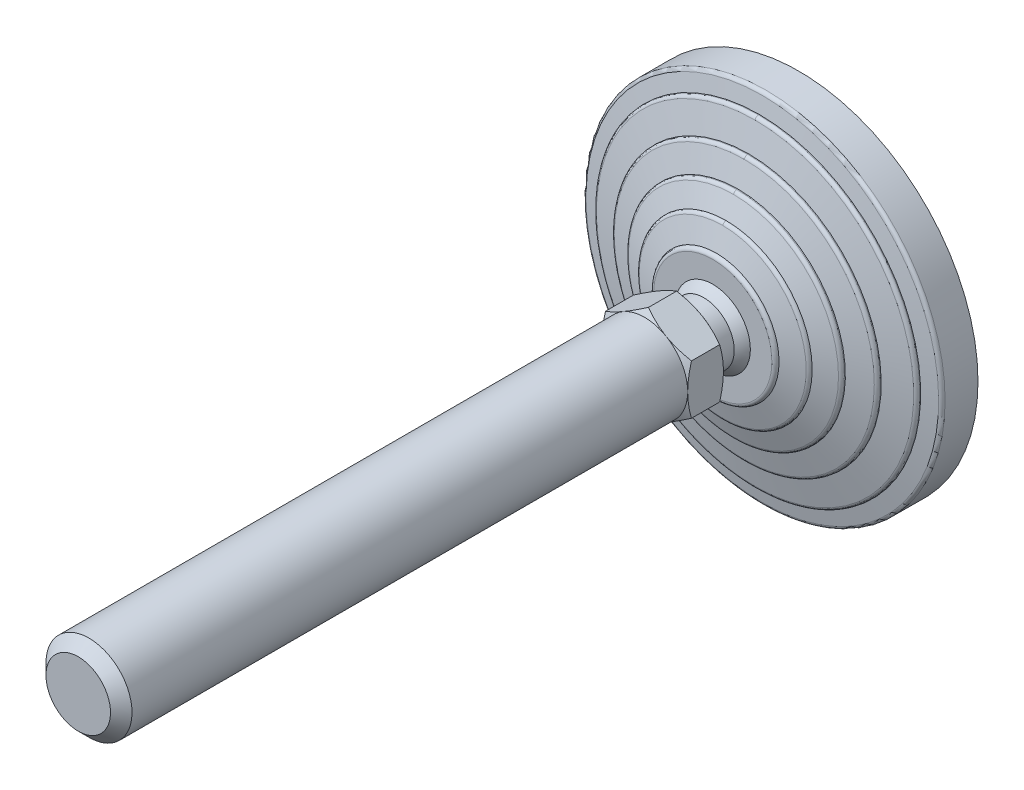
ISO-10303-21;
HEADER;
FILE_DESCRIPTION(('STEP AP214'),'2;1');
FILE_NAME('part.step','',(''),(''),'','','');
FILE_SCHEMA(('AUTOMOTIVE_DESIGN { 1 0 10303 214 1 1 1 1 }'));
ENDSEC;
DATA;
#1=APPLICATION_CONTEXT('core data for automotive mechanical design processes');
#2=APPLICATION_PROTOCOL_DEFINITION('international standard','automotive_design',2000,#1);
#3=PRODUCT_CONTEXT('',#1,'mechanical');
#4=PRODUCT('Part','Part','',(#3));
#5=PRODUCT_RELATED_PRODUCT_CATEGORY('part','',(#4));
#6=PRODUCT_DEFINITION_FORMATION('','',#4);
#7=PRODUCT_DEFINITION_CONTEXT('part definition',#1,'design');
#8=PRODUCT_DEFINITION('design','',#6,#7);
#9=PRODUCT_DEFINITION_SHAPE('','',#8);
#10=(LENGTH_UNIT() NAMED_UNIT(*) SI_UNIT(.MILLI.,.METRE.));
#11=(NAMED_UNIT(*) PLANE_ANGLE_UNIT() SI_UNIT($,.RADIAN.));
#12=(NAMED_UNIT(*) SI_UNIT($,.STERADIAN.) SOLID_ANGLE_UNIT());
#13=UNCERTAINTY_MEASURE_WITH_UNIT(LENGTH_MEASURE(1.E-05),#10,'distance_accuracy_value','');
#14=(GEOMETRIC_REPRESENTATION_CONTEXT(3) GLOBAL_UNCERTAINTY_ASSIGNED_CONTEXT((#13)) GLOBAL_UNIT_ASSIGNED_CONTEXT((#10,
#11,#12)) REPRESENTATION_CONTEXT('',''));
#15=CARTESIAN_POINT('',(0.,0.,0.));
#16=DIRECTION('',(0.,0.,1.));
#17=DIRECTION('',(1.,0.,0.));
#18=AXIS2_PLACEMENT_3D('',#15,#16,#17);
#19=CARTESIAN_POINT('',(-50.774113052,50.6,0.));
#20=DIRECTION('',(0.,0.,1.));
#21=DIRECTION('',(0.,-1.,0.));
#22=AXIS2_PLACEMENT_3D('',#19,#20,#21);
#23=PLANE('',#22);
#24=CARTESIAN_POINT('',(0.,0.,0.));
#25=DIRECTION('',(0.,0.,-1.));
#26=DIRECTION('',(1.,0.,0.));
#27=AXIS2_PLACEMENT_3D('',#24,#25,#26);
#28=CIRCLE('',#27,50.);
#29=CARTESIAN_POINT('',(50.,0.,0.));
#30=VERTEX_POINT('',#29);
#31=EDGE_CURVE('E437',#30,#30,#28,.F.);
#32=ORIENTED_EDGE('',*,*,#31,.F.);
#33=EDGE_LOOP('',(#32));
#34=FACE_BOUND('',#33,.T.);
#35=ADVANCED_FACE('F14',(#34),#23,.F.);
#36=CARTESIAN_POINT('',(0.,0.,9.180196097));
#37=DIRECTION('',(0.,0.,-1.));
#38=DIRECTION('',(1.,0.,0.));
#39=AXIS2_PLACEMENT_3D('',#36,#37,#38);
#40=CYLINDRICAL_SURFACE('',#39,50.);
#41=ORIENTED_EDGE('',*,*,#31,.T.);
#42=EDGE_LOOP('',(#41));
#43=FACE_BOUND('',#42,.T.);
#44=CARTESIAN_POINT('',(0.,0.,9.180196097));
#45=DIRECTION('',(0.,0.,1.));
#46=DIRECTION('',(0.,-1.,0.));
#47=AXIS2_PLACEMENT_3D('',#44,#45,#46);
#48=CIRCLE('',#47,50.);
#49=CARTESIAN_POINT('',(0.,-50.,9.180196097));
#50=VERTEX_POINT('',#49);
#51=EDGE_CURVE('E440',#50,#50,#48,.T.);
#52=ORIENTED_EDGE('',*,*,#51,.F.);
#53=EDGE_LOOP('',(#52));
#54=FACE_BOUND('',#53,.T.);
#55=ADVANCED_FACE('F291',(#43,#54),#40,.T.);
#56=CARTESIAN_POINT('',(0.,0.,9.18019609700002));
#57=DIRECTION('',(0.,0.,-1.));
#58=DIRECTION('',(0.,1.,0.));
#59=AXIS2_PLACEMENT_3D('',#56,#57,#58);
#60=TOROIDAL_SURFACE('',#59,48.9999999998,1.00000000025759);
#61=ORIENTED_EDGE('',*,*,#51,.T.);
#62=EDGE_LOOP('',(#61));
#63=FACE_BOUND('',#62,.T.);
#64=CARTESIAN_POINT('',(0.,0.,10.1607767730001));
#65=DIRECTION('',(0.,0.,-1.));
#66=DIRECTION('',(0.,1.,0.));
#67=AXIS2_PLACEMENT_3D('',#64,#65,#66);
#68=CIRCLE('',#67,49.196116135);
#69=CARTESIAN_POINT('',(0.,49.196116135,10.160776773));
#70=VERTEX_POINT('',#69);
#71=EDGE_CURVE('E441',#70,#70,#68,.F.);
#72=ORIENTED_EDGE('',*,*,#71,.F.);
#73=EDGE_LOOP('',(#72));
#74=FACE_BOUND('',#73,.T.);
#75=ADVANCED_FACE('F287',(#63,#74),#60,.T.);
#76=CARTESIAN_POINT('',(0.,0.,11.));
#77=DIRECTION('',(0.,0.,-1.));
#78=DIRECTION('',(0.,1.,0.));
#79=AXIS2_PLACEMENT_3D('',#76,#77,#78);
#80=CONICAL_SURFACE('',#79,45.,1.37340076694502);
#81=ORIENTED_EDGE('',*,*,#71,.T.);
#82=EDGE_LOOP('',(#81));
#83=FACE_BOUND('',#82,.T.);
#84=CARTESIAN_POINT('',(0.,0.,11.));
#85=DIRECTION('',(0.,0.,-1.));
#86=DIRECTION('',(0.,1.,0.));
#87=AXIS2_PLACEMENT_3D('',#84,#85,#86);
#88=CIRCLE('',#87,45.);
#89=CARTESIAN_POINT('',(0.,45.,11.));
#90=VERTEX_POINT('',#89);
#91=EDGE_CURVE('E444',#90,#90,#88,.F.);
#92=ORIENTED_EDGE('',*,*,#91,.F.);
#93=EDGE_LOOP('',(#92));
#94=FACE_BOUND('',#93,.T.);
#95=ADVANCED_FACE('F290',(#83,#94),#80,.T.);
#96=CARTESIAN_POINT('',(0.,0.,11.219223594));
#97=DIRECTION('',(0.,0.,-1.));
#98=DIRECTION('',(0.,1.,0.));
#99=AXIS2_PLACEMENT_3D('',#96,#97,#98);
#100=CYLINDRICAL_SURFACE('',#99,45.);
#101=ORIENTED_EDGE('',*,*,#91,.T.);
#102=EDGE_LOOP('',(#101));
#103=FACE_BOUND('',#102,.T.);
#104=CARTESIAN_POINT('',(0.,0.,11.219223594));
#105=DIRECTION('',(0.,0.,1.));
#106=DIRECTION('',(0.,-1.,0.));
#107=AXIS2_PLACEMENT_3D('',#104,#105,#106);
#108=CIRCLE('',#107,45.);
#109=CARTESIAN_POINT('',(-4.61482714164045E-09,-45.,11.219223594));
#110=VERTEX_POINT('',#109);
#111=CARTESIAN_POINT('',(0.,45.,11.219223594));
#112=VERTEX_POINT('',#111);
#113=EDGE_CURVE('E643',#110,#112,#108,.T.);
#114=ORIENTED_EDGE('',*,*,#113,.F.);
#115=CARTESIAN_POINT('',(0.,0.,11.219223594));
#116=DIRECTION('',(0.,0.,1.));
#117=DIRECTION('',(0.,-1.,0.));
#118=AXIS2_PLACEMENT_3D('',#115,#116,#117);
#119=CIRCLE('',#118,45.);
#120=EDGE_CURVE('E654',#112,#110,#119,.T.);
#121=ORIENTED_EDGE('',*,*,#120,.F.);
#122=EDGE_LOOP('',(#114,#121));
#123=FACE_BOUND('',#122,.T.);
#124=ADVANCED_FACE('F416',(#103,#123),#100,.T.);
#125=CARTESIAN_POINT('',(0.,-45.,11.219223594));
#126=CARTESIAN_POINT('',(-90.0000000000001,-45.,11.219223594));
#127=CARTESIAN_POINT('',(-90.0000000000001,45.,11.219223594));
#128=CARTESIAN_POINT('',(0.,45.,11.219223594));
#129=CARTESIAN_POINT('',(0.,-45.,11.696951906));
#130=CARTESIAN_POINT('',(-90.0000000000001,-45.,11.696951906));
#131=CARTESIAN_POINT('',(-90.0000000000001,45.,11.696951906));
#132=CARTESIAN_POINT('',(0.,45.,11.696951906));
#133=CARTESIAN_POINT('',(0.,-44.706000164,12.073499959));
#134=CARTESIAN_POINT('',(-89.412000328,-44.706000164,12.073499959));
#135=CARTESIAN_POINT('',(-89.412000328,44.706000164,12.073499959));
#136=CARTESIAN_POINT('',(0.,44.706000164,12.073499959));
#137=CARTESIAN_POINT('',(0.,-44.242535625,12.189366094));
#138=CARTESIAN_POINT('',(-88.4850712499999,-44.2425356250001,12.189366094));
#139=CARTESIAN_POINT('',(-88.4850712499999,44.2425356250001,12.189366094));
#140=CARTESIAN_POINT('',(0.,44.242535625,12.189366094));
#141=(BOUNDED_SURFACE() B_SPLINE_SURFACE(3,3,((#125,#126,#127,#128),(#129,#130,#131,#132),(#133,
#134,#135,#136),(#137,#138,#139,#140)),.UNSPECIFIED.,.F.,.F.,
.F.) B_SPLINE_SURFACE_WITH_KNOTS((4,4),(4,4),(0.,1.),(0.,1.),
.UNSPECIFIED.) GEOMETRIC_REPRESENTATION_ITEM() RATIONAL_B_SPLINE_SURFACE(((1.,0.333333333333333,
0.333333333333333,1.),(0.858803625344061,0.286267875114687,0.286267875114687,0.858803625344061),
(0.858803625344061,0.286267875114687,0.286267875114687,0.858803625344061),(1.,0.333333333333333,
0.333333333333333,1.))) REPRESENTATION_ITEM('') SURFACE());
#142=CARTESIAN_POINT('',(0.,45.,11.219223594));
#143=CARTESIAN_POINT('',(0.,45.,11.696951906));
#144=CARTESIAN_POINT('',(0.,44.706000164,12.073499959));
#145=CARTESIAN_POINT('',(0.,44.242535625,12.189366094));
#146=(BOUNDED_CURVE() B_SPLINE_CURVE(3,(#142,#143,#144,#145),.UNSPECIFIED.,.F.,
.F.) B_SPLINE_CURVE_WITH_KNOTS((4,4),(0.,1.),
.UNSPECIFIED.) CURVE() GEOMETRIC_REPRESENTATION_ITEM() RATIONAL_B_SPLINE_CURVE((1.,
0.858803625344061,0.858803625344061,1.)) REPRESENTATION_ITEM(''));
#147=CARTESIAN_POINT('',(0.,44.242535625,12.189366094));
#148=VERTEX_POINT('',#147);
#149=EDGE_CURVE('E634',#112,#148,#146,.T.);
#150=CARTESIAN_POINT('',(0.,-45.,11.219223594));
#151=CARTESIAN_POINT('',(0.,-45.,11.696951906));
#152=CARTESIAN_POINT('',(0.,-44.706000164,12.073499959));
#153=CARTESIAN_POINT('',(0.,-44.242535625,12.189366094));
#154=(BOUNDED_CURVE() B_SPLINE_CURVE(3,(#150,#151,#152,#153),.UNSPECIFIED.,.F.,
.F.) B_SPLINE_CURVE_WITH_KNOTS((4,4),(0.,1.),
.UNSPECIFIED.) CURVE() GEOMETRIC_REPRESENTATION_ITEM() RATIONAL_B_SPLINE_CURVE((1.,
0.858803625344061,0.858803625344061,1.)) REPRESENTATION_ITEM(''));
#155=CARTESIAN_POINT('',(-1.3611443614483E-08,-44.242535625,12.189366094));
#156=VERTEX_POINT('',#155);
#157=EDGE_CURVE('E648',#156,#110,#154,.F.);
#158=CARTESIAN_POINT('',(0.,0.,12.189366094));
#159=DIRECTION('',(0.,0.,-1.));
#160=DIRECTION('',(0.,1.,0.));
#161=AXIS2_PLACEMENT_3D('',#158,#159,#160);
#162=CIRCLE('',#161,44.242535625);
#163=EDGE_CURVE('E631',#148,#156,#162,.F.);
#164=ORIENTED_EDGE('',*,*,#149,.F.);
#165=ORIENTED_EDGE('',*,*,#120,.T.);
#166=ORIENTED_EDGE('',*,*,#157,.F.);
#167=ORIENTED_EDGE('',*,*,#163,.F.);
#168=EDGE_LOOP('',(#164,#165,#166,#167));
#169=FACE_BOUND('',#168,.T.);
#170=ADVANCED_FACE('F405',(#169),#141,.T.);
#171=CARTESIAN_POINT('',(0.,45.,11.219223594));
#172=CARTESIAN_POINT('',(90.0000000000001,45.,11.219223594));
#173=CARTESIAN_POINT('',(90.0000000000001,-45.,11.219223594));
#174=CARTESIAN_POINT('',(0.,-45.,11.219223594));
#175=CARTESIAN_POINT('',(0.,45.,11.696951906));
#176=CARTESIAN_POINT('',(90.0000000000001,45.,11.696951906));
#177=CARTESIAN_POINT('',(90.0000000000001,-45.,11.696951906));
#178=CARTESIAN_POINT('',(0.,-45.,11.696951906));
#179=CARTESIAN_POINT('',(0.,44.706000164,12.073499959));
#180=CARTESIAN_POINT('',(89.412000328,44.706000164,12.073499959));
#181=CARTESIAN_POINT('',(89.412000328,-44.706000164,12.073499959));
#182=CARTESIAN_POINT('',(0.,-44.706000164,12.073499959));
#183=CARTESIAN_POINT('',(0.,44.242535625,12.189366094));
#184=CARTESIAN_POINT('',(88.4850712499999,44.2425356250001,12.189366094));
#185=CARTESIAN_POINT('',(88.4850712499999,-44.2425356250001,12.189366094));
#186=CARTESIAN_POINT('',(0.,-44.242535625,12.189366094));
#187=(BOUNDED_SURFACE() B_SPLINE_SURFACE(3,3,((#171,#172,#173,#174),(#175,#176,#177,#178),(#179,
#180,#181,#182),(#183,#184,#185,#186)),.UNSPECIFIED.,.F.,.F.,
.F.) B_SPLINE_SURFACE_WITH_KNOTS((4,4),(4,4),(0.,1.),(0.,1.),
.UNSPECIFIED.) GEOMETRIC_REPRESENTATION_ITEM() RATIONAL_B_SPLINE_SURFACE(((1.,0.333333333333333,
0.333333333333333,1.),(0.858803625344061,0.286267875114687,0.286267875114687,0.858803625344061),
(0.858803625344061,0.286267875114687,0.286267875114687,0.858803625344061),(1.,0.333333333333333,
0.333333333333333,1.))) REPRESENTATION_ITEM('') SURFACE());
#188=CARTESIAN_POINT('',(0.,0.,12.189366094));
#189=DIRECTION('',(0.,0.,-1.));
#190=DIRECTION('',(0.,1.,0.));
#191=AXIS2_PLACEMENT_3D('',#188,#189,#190);
#192=CIRCLE('',#191,44.242535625);
#193=EDGE_CURVE('E630',#156,#148,#192,.F.);
#194=ORIENTED_EDGE('',*,*,#113,.T.);
#195=ORIENTED_EDGE('',*,*,#149,.T.);
#196=ORIENTED_EDGE('',*,*,#193,.F.);
#197=ORIENTED_EDGE('',*,*,#157,.T.);
#198=EDGE_LOOP('',(#194,#195,#196,#197));
#199=FACE_BOUND('',#198,.T.);
#200=ADVANCED_FACE('F399',(#199),#187,.T.);
#201=CARTESIAN_POINT('',(0.,0.,14.));
#202=DIRECTION('',(0.,0.,-1.));
#203=DIRECTION('',(1.,0.,0.));
#204=AXIS2_PLACEMENT_3D('',#201,#202,#203);
#205=CONICAL_SURFACE('',#204,37.,1.32581766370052);
#206=ORIENTED_EDGE('',*,*,#163,.T.);
#207=ORIENTED_EDGE('',*,*,#193,.T.);
#208=EDGE_LOOP('',(#206,#207));
#209=FACE_BOUND('',#208,.T.);
#210=CARTESIAN_POINT('',(0.,0.,14.));
#211=DIRECTION('',(0.,0.,-1.));
#212=DIRECTION('',(0.,1.,0.));
#213=AXIS2_PLACEMENT_3D('',#210,#211,#212);
#214=CIRCLE('',#213,37.);
#215=CARTESIAN_POINT('',(0.,37.,14.));
#216=VERTEX_POINT('',#215);
#217=EDGE_CURVE('E621',#216,#216,#214,.F.);
#218=ORIENTED_EDGE('',*,*,#217,.F.);
#219=EDGE_LOOP('',(#218));
#220=FACE_BOUND('',#219,.T.);
#221=ADVANCED_FACE('F395',(#209,#220),#205,.T.);
#222=CARTESIAN_POINT('',(0.,0.,14.245698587));
#223=DIRECTION('',(0.,0.,-1.));
#224=DIRECTION('',(1.,0.,0.));
#225=AXIS2_PLACEMENT_3D('',#222,#223,#224);
#226=CYLINDRICAL_SURFACE('',#225,37.);
#227=ORIENTED_EDGE('',*,*,#217,.T.);
#228=EDGE_LOOP('',(#227));
#229=FACE_BOUND('',#228,.T.);
#230=CARTESIAN_POINT('',(0.,0.,14.245698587));
#231=DIRECTION('',(0.,0.,1.));
#232=DIRECTION('',(0.,-1.,0.));
#233=AXIS2_PLACEMENT_3D('',#230,#231,#232);
#234=CIRCLE('',#233,37.);
#235=CARTESIAN_POINT('',(-3.79441342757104E-09,-37.,14.245698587));
#236=VERTEX_POINT('',#235);
#237=CARTESIAN_POINT('',(0.,37.,14.245698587));
#238=VERTEX_POINT('',#237);
#239=EDGE_CURVE('E601',#236,#238,#234,.T.);
#240=ORIENTED_EDGE('',*,*,#239,.F.);
#241=CARTESIAN_POINT('',(0.,0.,14.245698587));
#242=DIRECTION('',(0.,0.,1.));
#243=DIRECTION('',(0.,-1.,0.));
#244=AXIS2_PLACEMENT_3D('',#241,#242,#243);
#245=CIRCLE('',#244,37.);
#246=EDGE_CURVE('E612',#238,#236,#245,.T.);
#247=ORIENTED_EDGE('',*,*,#246,.F.);
#248=EDGE_LOOP('',(#240,#247));
#249=FACE_BOUND('',#248,.T.);
#250=ADVANCED_FACE('F386',(#229,#249),#226,.T.);
#251=CARTESIAN_POINT('',(0.,-37.,14.245698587));
#252=CARTESIAN_POINT('',(-74.,-37.,14.245698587));
#253=CARTESIAN_POINT('',(-74.,37.,14.245698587));
#254=CARTESIAN_POINT('',(0.,37.,14.245698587));
#255=CARTESIAN_POINT('',(0.,-37.,14.709515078));
#256=CARTESIAN_POINT('',(-74.0000000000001,-37.,14.709515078));
#257=CARTESIAN_POINT('',(-74.0000000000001,37.,14.709515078));
#258=CARTESIAN_POINT('',(0.,37.,14.709515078));
#259=CARTESIAN_POINT('',(0.,-36.720691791,15.079802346));
#260=CARTESIAN_POINT('',(-73.441383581,-36.720691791,15.079802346));
#261=CARTESIAN_POINT('',(-73.441383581,36.720691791,15.079802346));
#262=CARTESIAN_POINT('',(0.,36.720691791,15.079802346));
#263=CARTESIAN_POINT('',(0.,-36.274721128,15.207222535));
#264=CARTESIAN_POINT('',(-72.549442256,-36.274721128,15.207222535));
#265=CARTESIAN_POINT('',(-72.549442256,36.274721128,15.207222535));
#266=CARTESIAN_POINT('',(0.,36.274721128,15.207222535));
#267=(BOUNDED_SURFACE() B_SPLINE_SURFACE(3,3,((#251,#252,#253,#254),(#255,#256,#257,#258),(#259,
#260,#261,#262),(#263,#264,#265,#266)),.UNSPECIFIED.,.F.,.F.,
.F.) B_SPLINE_SURFACE_WITH_KNOTS((4,4),(4,4),(0.,1.),(0.,1.),
.UNSPECIFIED.) GEOMETRIC_REPRESENTATION_ITEM() RATIONAL_B_SPLINE_SURFACE(((1.,0.333333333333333,
0.333333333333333,1.),(0.865565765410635,0.288521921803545,0.288521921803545,0.865565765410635),
(0.865565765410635,0.288521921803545,0.288521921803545,0.865565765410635),(1.,0.333333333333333,
0.333333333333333,1.))) REPRESENTATION_ITEM('') SURFACE());
#268=CARTESIAN_POINT('',(0.,37.,14.245698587));
#269=CARTESIAN_POINT('',(0.,37.,14.709515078));
#270=CARTESIAN_POINT('',(0.,36.720691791,15.079802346));
#271=CARTESIAN_POINT('',(0.,36.274721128,15.207222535));
#272=(BOUNDED_CURVE() B_SPLINE_CURVE(3,(#268,#269,#270,#271),.UNSPECIFIED.,.F.,
.F.) B_SPLINE_CURVE_WITH_KNOTS((4,4),(0.,1.),
.UNSPECIFIED.) CURVE() GEOMETRIC_REPRESENTATION_ITEM() RATIONAL_B_SPLINE_CURVE((1.,
0.865565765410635,0.865565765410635,1.)) REPRESENTATION_ITEM(''));
#273=CARTESIAN_POINT('',(0.,36.274721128,15.2072225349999));
#274=VERTEX_POINT('',#273);
#275=EDGE_CURVE('E592',#238,#274,#272,.T.);
#276=CARTESIAN_POINT('',(0.,-37.,14.245698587));
#277=CARTESIAN_POINT('',(0.,-37.,14.709515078));
#278=CARTESIAN_POINT('',(0.,-36.720691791,15.079802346));
#279=CARTESIAN_POINT('',(0.,-36.274721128,15.207222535));
#280=(BOUNDED_CURVE() B_SPLINE_CURVE(3,(#276,#277,#278,#279),.UNSPECIFIED.,.F.,
.F.) B_SPLINE_CURVE_WITH_KNOTS((4,4),(0.,1.),
.UNSPECIFIED.) CURVE() GEOMETRIC_REPRESENTATION_ITEM() RATIONAL_B_SPLINE_CURVE((1.,
0.865565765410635,0.865565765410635,1.)) REPRESENTATION_ITEM(''));
#281=CARTESIAN_POINT('',(-1.11601045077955E-08,-36.274721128,15.2072225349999));
#282=VERTEX_POINT('',#281);
#283=EDGE_CURVE('E606',#282,#236,#280,.F.);
#284=CARTESIAN_POINT('',(0.,0.,15.2072225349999));
#285=DIRECTION('',(0.,0.,-1.));
#286=DIRECTION('',(0.,1.,0.));
#287=AXIS2_PLACEMENT_3D('',#284,#285,#286);
#288=CIRCLE('',#287,36.274721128);
#289=EDGE_CURVE('E589',#274,#282,#288,.F.);
#290=ORIENTED_EDGE('',*,*,#275,.F.);
#291=ORIENTED_EDGE('',*,*,#246,.T.);
#292=ORIENTED_EDGE('',*,*,#283,.F.);
#293=ORIENTED_EDGE('',*,*,#289,.F.);
#294=EDGE_LOOP('',(#290,#291,#292,#293));
#295=FACE_BOUND('',#294,.T.);
#296=ADVANCED_FACE('F375',(#295),#267,.T.);
#297=CARTESIAN_POINT('',(0.,37.,14.245698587));
#298=CARTESIAN_POINT('',(74.,37.,14.245698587));
#299=CARTESIAN_POINT('',(74.,-37.,14.245698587));
#300=CARTESIAN_POINT('',(0.,-37.,14.245698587));
#301=CARTESIAN_POINT('',(0.,37.,14.709515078));
#302=CARTESIAN_POINT('',(74.0000000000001,37.,14.709515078));
#303=CARTESIAN_POINT('',(74.0000000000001,-37.,14.709515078));
#304=CARTESIAN_POINT('',(0.,-37.,14.709515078));
#305=CARTESIAN_POINT('',(0.,36.720691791,15.079802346));
#306=CARTESIAN_POINT('',(73.441383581,36.720691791,15.079802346));
#307=CARTESIAN_POINT('',(73.441383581,-36.720691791,15.079802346));
#308=CARTESIAN_POINT('',(0.,-36.720691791,15.079802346));
#309=CARTESIAN_POINT('',(0.,36.274721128,15.207222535));
#310=CARTESIAN_POINT('',(72.549442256,36.274721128,15.207222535));
#311=CARTESIAN_POINT('',(72.549442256,-36.274721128,15.207222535));
#312=CARTESIAN_POINT('',(0.,-36.274721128,15.207222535));
#313=(BOUNDED_SURFACE() B_SPLINE_SURFACE(3,3,((#297,#298,#299,#300),(#301,#302,#303,#304),(#305,
#306,#307,#308),(#309,#310,#311,#312)),.UNSPECIFIED.,.F.,.F.,
.F.) B_SPLINE_SURFACE_WITH_KNOTS((4,4),(4,4),(0.,1.),(0.,1.),
.UNSPECIFIED.) GEOMETRIC_REPRESENTATION_ITEM() RATIONAL_B_SPLINE_SURFACE(((1.,0.333333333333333,
0.333333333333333,1.),(0.865565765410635,0.288521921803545,0.288521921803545,0.865565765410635),
(0.865565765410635,0.288521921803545,0.288521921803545,0.865565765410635),(1.,0.333333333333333,
0.333333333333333,1.))) REPRESENTATION_ITEM('') SURFACE());
#314=CARTESIAN_POINT('',(0.,0.,15.2072225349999));
#315=DIRECTION('',(0.,0.,-1.));
#316=DIRECTION('',(0.,1.,0.));
#317=AXIS2_PLACEMENT_3D('',#314,#315,#316);
#318=CIRCLE('',#317,36.274721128);
#319=EDGE_CURVE('E588',#282,#274,#318,.F.);
#320=ORIENTED_EDGE('',*,*,#239,.T.);
#321=ORIENTED_EDGE('',*,*,#275,.T.);
#322=ORIENTED_EDGE('',*,*,#319,.F.);
#323=ORIENTED_EDGE('',*,*,#283,.T.);
#324=EDGE_LOOP('',(#320,#321,#322,#323));
#325=FACE_BOUND('',#324,.T.);
#326=ADVANCED_FACE('F369',(#325),#313,.T.);
#327=CARTESIAN_POINT('',(0.,0.,17.));
#328=DIRECTION('',(0.,0.,-1.));
#329=DIRECTION('',(0.,1.,0.));
#330=AXIS2_PLACEMENT_3D('',#327,#328,#329);
#331=CONICAL_SURFACE('',#330,30.,1.29249666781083);
#332=ORIENTED_EDGE('',*,*,#289,.T.);
#333=ORIENTED_EDGE('',*,*,#319,.T.);
#334=EDGE_LOOP('',(#332,#333));
#335=FACE_BOUND('',#334,.T.);
#336=CARTESIAN_POINT('',(0.,0.,17.));
#337=DIRECTION('',(0.,0.,-1.));
#338=DIRECTION('',(0.,1.,0.));
#339=AXIS2_PLACEMENT_3D('',#336,#337,#338);
#340=CIRCLE('',#339,30.);
#341=CARTESIAN_POINT('',(0.,30.,17.));
#342=VERTEX_POINT('',#341);
#343=EDGE_CURVE('E579',#342,#342,#340,.F.);
#344=ORIENTED_EDGE('',*,*,#343,.F.);
#345=EDGE_LOOP('',(#344));
#346=FACE_BOUND('',#345,.T.);
#347=ADVANCED_FACE('F365',(#335,#346),#331,.T.);
#348=CARTESIAN_POINT('',(0.,0.,17.27924078));
#349=DIRECTION('',(0.,0.,-1.));
#350=DIRECTION('',(0.,1.,0.));
#351=AXIS2_PLACEMENT_3D('',#348,#349,#350);
#352=CYLINDRICAL_SURFACE('',#351,30.);
#353=ORIENTED_EDGE('',*,*,#343,.T.);
#354=EDGE_LOOP('',(#353));
#355=FACE_BOUND('',#354,.T.);
#356=CARTESIAN_POINT('',(0.,0.,17.27924078));
#357=DIRECTION('',(0.,0.,1.));
#358=DIRECTION('',(0.,-1.,0.));
#359=AXIS2_PLACEMENT_3D('',#356,#357,#358);
#360=CIRCLE('',#359,30.);
#361=CARTESIAN_POINT('',(-3.0765514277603E-09,-30.,17.27924078));
#362=VERTEX_POINT('',#361);
#363=CARTESIAN_POINT('',(0.,30.,17.27924078));
#364=VERTEX_POINT('',#363);
#365=EDGE_CURVE('E559',#362,#364,#360,.T.);
#366=ORIENTED_EDGE('',*,*,#365,.F.);
#367=CARTESIAN_POINT('',(0.,0.,17.27924078));
#368=DIRECTION('',(0.,0.,1.));
#369=DIRECTION('',(0.,-1.,0.));
#370=AXIS2_PLACEMENT_3D('',#367,#368,#369);
#371=CIRCLE('',#370,30.);
#372=EDGE_CURVE('E570',#364,#362,#371,.T.);
#373=ORIENTED_EDGE('',*,*,#372,.F.);
#374=EDGE_LOOP('',(#366,#373));
#375=FACE_BOUND('',#374,.T.);
#376=ADVANCED_FACE('F356',(#355,#375),#352,.T.);
#377=CARTESIAN_POINT('',(0.,-30.,17.27924078));
#378=CARTESIAN_POINT('',(-60.0000000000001,-30.,17.27924078));
#379=CARTESIAN_POINT('',(-60.0000000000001,30.,17.27924078));
#380=CARTESIAN_POINT('',(0.,30.,17.27924078));
#381=CARTESIAN_POINT('',(0.,-30.,17.725161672));
#382=CARTESIAN_POINT('',(-59.9999999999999,-30.,17.725161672));
#383=CARTESIAN_POINT('',(-59.9999999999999,30.,17.725161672));
#384=CARTESIAN_POINT('',(0.,30.,17.725161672));
#385=CARTESIAN_POINT('',(0.,-29.739265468,18.086911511));
#386=CARTESIAN_POINT('',(-59.478530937,-29.739265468,18.086911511));
#387=CARTESIAN_POINT('',(-59.478530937,29.739265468,18.086911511));
#388=CARTESIAN_POINT('',(0.,29.739265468,18.086911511));
#389=CARTESIAN_POINT('',(0.,-29.316227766,18.227924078));
#390=CARTESIAN_POINT('',(-58.6324555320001,-29.316227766,18.227924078));
#391=CARTESIAN_POINT('',(-58.6324555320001,29.316227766,18.227924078));
#392=CARTESIAN_POINT('',(0.,29.316227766,18.227924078));
#393=(BOUNDED_SURFACE() B_SPLINE_SURFACE(3,3,((#377,#378,#379,#380),(#381,#382,#383,#384),(#385,
#386,#387,#388),(#389,#390,#391,#392)),.UNSPECIFIED.,.F.,.F.,
.F.) B_SPLINE_SURFACE_WITH_KNOTS((4,4),(4,4),(0.,1.),(0.,1.),
.UNSPECIFIED.) GEOMETRIC_REPRESENTATION_ITEM() RATIONAL_B_SPLINE_SURFACE(((1.,0.333333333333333,
0.333333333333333,1.),(0.874161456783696,0.291387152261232,0.291387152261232,0.874161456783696),
(0.874161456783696,0.291387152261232,0.291387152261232,0.874161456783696),(1.,0.333333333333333,
0.333333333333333,1.))) REPRESENTATION_ITEM('') SURFACE());
#394=CARTESIAN_POINT('',(0.,30.,17.27924078));
#395=CARTESIAN_POINT('',(0.,30.,17.725161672));
#396=CARTESIAN_POINT('',(0.,29.739265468,18.086911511));
#397=CARTESIAN_POINT('',(0.,29.316227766,18.227924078));
#398=(BOUNDED_CURVE() B_SPLINE_CURVE(3,(#394,#395,#396,#397),.UNSPECIFIED.,.F.,
.F.) B_SPLINE_CURVE_WITH_KNOTS((4,4),(0.,1.),
.UNSPECIFIED.) CURVE() GEOMETRIC_REPRESENTATION_ITEM() RATIONAL_B_SPLINE_CURVE((1.,
0.874161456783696,0.874161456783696,1.)) REPRESENTATION_ITEM(''));
#399=CARTESIAN_POINT('',(0.,29.3162277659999,18.2279240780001));
#400=VERTEX_POINT('',#399);
#401=EDGE_CURVE('E550',#364,#400,#398,.T.);
#402=CARTESIAN_POINT('',(0.,-30.,17.27924078));
#403=CARTESIAN_POINT('',(0.,-30.,17.725161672));
#404=CARTESIAN_POINT('',(0.,-29.739265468,18.086911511));
#405=CARTESIAN_POINT('',(0.,-29.316227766,18.227924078));
#406=(BOUNDED_CURVE() B_SPLINE_CURVE(3,(#402,#403,#404,#405),.UNSPECIFIED.,.F.,
.F.) B_SPLINE_CURVE_WITH_KNOTS((4,4),(0.,1.),
.UNSPECIFIED.) CURVE() GEOMETRIC_REPRESENTATION_ITEM() RATIONAL_B_SPLINE_CURVE((1.,
0.874161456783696,0.874161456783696,1.)) REPRESENTATION_ITEM(''));
#407=CARTESIAN_POINT('',(-9.01928823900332E-09,-29.3162277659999,18.2279240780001));
#408=VERTEX_POINT('',#407);
#409=EDGE_CURVE('E564',#408,#362,#406,.F.);
#410=CARTESIAN_POINT('',(0.,0.,18.2279240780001));
#411=DIRECTION('',(0.,0.,-1.));
#412=DIRECTION('',(0.,1.,0.));
#413=AXIS2_PLACEMENT_3D('',#410,#411,#412);
#414=CIRCLE('',#413,29.316227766);
#415=EDGE_CURVE('E547',#400,#408,#414,.F.);
#416=ORIENTED_EDGE('',*,*,#401,.F.);
#417=ORIENTED_EDGE('',*,*,#372,.T.);
#418=ORIENTED_EDGE('',*,*,#409,.F.);
#419=ORIENTED_EDGE('',*,*,#415,.F.);
#420=EDGE_LOOP('',(#416,#417,#418,#419));
#421=FACE_BOUND('',#420,.T.);
#422=ADVANCED_FACE('F345',(#421),#393,.T.);
#423=CARTESIAN_POINT('',(0.,30.,17.27924078));
#424=CARTESIAN_POINT('',(60.0000000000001,30.,17.27924078));
#425=CARTESIAN_POINT('',(60.0000000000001,-30.,17.27924078));
#426=CARTESIAN_POINT('',(0.,-30.,17.27924078));
#427=CARTESIAN_POINT('',(0.,30.,17.725161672));
#428=CARTESIAN_POINT('',(59.9999999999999,30.,17.725161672));
#429=CARTESIAN_POINT('',(59.9999999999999,-30.,17.725161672));
#430=CARTESIAN_POINT('',(0.,-30.,17.725161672));
#431=CARTESIAN_POINT('',(0.,29.739265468,18.086911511));
#432=CARTESIAN_POINT('',(59.478530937,29.739265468,18.086911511));
#433=CARTESIAN_POINT('',(59.478530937,-29.739265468,18.086911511));
#434=CARTESIAN_POINT('',(0.,-29.739265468,18.086911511));
#435=CARTESIAN_POINT('',(0.,29.316227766,18.227924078));
#436=CARTESIAN_POINT('',(58.6324555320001,29.316227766,18.227924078));
#437=CARTESIAN_POINT('',(58.6324555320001,-29.316227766,18.227924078));
#438=CARTESIAN_POINT('',(0.,-29.316227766,18.227924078));
#439=(BOUNDED_SURFACE() B_SPLINE_SURFACE(3,3,((#423,#424,#425,#426),(#427,#428,#429,#430),(#431,
#432,#433,#434),(#435,#436,#437,#438)),.UNSPECIFIED.,.F.,.F.,
.F.) B_SPLINE_SURFACE_WITH_KNOTS((4,4),(4,4),(0.,1.),(0.,1.),
.UNSPECIFIED.) GEOMETRIC_REPRESENTATION_ITEM() RATIONAL_B_SPLINE_SURFACE(((1.,0.333333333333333,
0.333333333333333,1.),(0.874161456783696,0.291387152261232,0.291387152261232,0.874161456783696),
(0.874161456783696,0.291387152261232,0.291387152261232,0.874161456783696),(1.,0.333333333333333,
0.333333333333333,1.))) REPRESENTATION_ITEM('') SURFACE());
#440=CARTESIAN_POINT('',(0.,0.,18.2279240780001));
#441=DIRECTION('',(0.,0.,-1.));
#442=DIRECTION('',(0.,1.,0.));
#443=AXIS2_PLACEMENT_3D('',#440,#441,#442);
#444=CIRCLE('',#443,29.316227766);
#445=EDGE_CURVE('E540',#408,#400,#444,.F.);
#446=ORIENTED_EDGE('',*,*,#365,.T.);
#447=ORIENTED_EDGE('',*,*,#401,.T.);
#448=ORIENTED_EDGE('',*,*,#445,.F.);
#449=ORIENTED_EDGE('',*,*,#409,.T.);
#450=EDGE_LOOP('',(#446,#447,#448,#449));
#451=FACE_BOUND('',#450,.T.);
#452=ADVANCED_FACE('F339',(#451),#439,.T.);
#453=CARTESIAN_POINT('',(0.,0.,20.261425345));
#454=DIRECTION('',(0.,0.,-1.));
#455=DIRECTION('',(0.,1.,0.));
#456=AXIS2_PLACEMENT_3D('',#453,#454,#455);
#457=CONICAL_SURFACE('',#456,24.,1.20545933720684);
#458=ORIENTED_EDGE('',*,*,#415,.T.);
#459=ORIENTED_EDGE('',*,*,#445,.T.);
#460=EDGE_LOOP('',(#458,#459));
#461=FACE_BOUND('',#460,.T.);
#462=CARTESIAN_POINT('',(0.,0.,20.261425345));
#463=DIRECTION('',(0.,0.,1.));
#464=DIRECTION('',(0.,-1.,0.));
#465=AXIS2_PLACEMENT_3D('',#462,#463,#464);
#466=CIRCLE('',#465,24.);
#467=CARTESIAN_POINT('',(-2.46124114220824E-09,-24.,20.261425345));
#468=VERTEX_POINT('',#467);
#469=CARTESIAN_POINT('',(0.,24.,20.261425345));
#470=VERTEX_POINT('',#469);
#471=EDGE_CURVE('E520',#468,#470,#466,.T.);
#472=ORIENTED_EDGE('',*,*,#471,.F.);
#473=CARTESIAN_POINT('',(0.,0.,20.261425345));
#474=DIRECTION('',(0.,0.,1.));
#475=DIRECTION('',(0.,-1.,0.));
#476=AXIS2_PLACEMENT_3D('',#473,#474,#475);
#477=CIRCLE('',#476,24.);
#478=EDGE_CURVE('E531',#470,#468,#477,.T.);
#479=ORIENTED_EDGE('',*,*,#478,.F.);
#480=EDGE_LOOP('',(#472,#479));
#481=FACE_BOUND('',#480,.T.);
#482=ADVANCED_FACE('F330',(#461,#481),#457,.T.);
#483=CARTESIAN_POINT('',(0.,-24.,20.261425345));
#484=CARTESIAN_POINT('',(-48.,-24.,20.261425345));
#485=CARTESIAN_POINT('',(-48.,24.,20.261425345));
#486=CARTESIAN_POINT('',(0.,24.,20.261425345));
#487=CARTESIAN_POINT('',(0.,-24.,20.716888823));
#488=CARTESIAN_POINT('',(-48.,-24.,20.716888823));
#489=CARTESIAN_POINT('',(-48.,24.,20.716888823));
#490=CARTESIAN_POINT('',(0.,24.,20.716888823));
#491=CARTESIAN_POINT('',(0.,-23.72940828,21.083258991));
#492=CARTESIAN_POINT('',(-47.458816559,-23.72940828,21.083258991));
#493=CARTESIAN_POINT('',(-47.458816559,23.72940828,21.083258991));
#494=CARTESIAN_POINT('',(0.,23.72940828,21.083258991));
#495=CARTESIAN_POINT('',(0.,-23.294085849,21.217204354));
#496=CARTESIAN_POINT('',(-46.5881716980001,-23.294085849,21.217204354));
#497=CARTESIAN_POINT('',(-46.5881716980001,23.294085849,21.217204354));
#498=CARTESIAN_POINT('',(0.,23.294085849,21.217204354));
#499=(BOUNDED_SURFACE() B_SPLINE_SURFACE(3,3,((#483,#484,#485,#486),(#487,#488,#489,#490),(#491,
#492,#493,#494),(#495,#496,#497,#498)),.UNSPECIFIED.,.F.,.F.,
.F.) B_SPLINE_SURFACE_WITH_KNOTS((4,4),(4,4),(0.,1.),(0.,1.),
.UNSPECIFIED.) GEOMETRIC_REPRESENTATION_ITEM() RATIONAL_B_SPLINE_SURFACE(((1.,0.333333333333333,
0.333333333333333,1.),(0.869593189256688,0.289864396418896,0.289864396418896,0.869593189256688),
(0.869593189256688,0.289864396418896,0.289864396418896,0.869593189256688),(1.,0.333333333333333,
0.333333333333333,1.))) REPRESENTATION_ITEM('') SURFACE());
#500=CARTESIAN_POINT('',(0.,24.,20.261425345));
#501=CARTESIAN_POINT('',(0.,24.,20.716888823));
#502=CARTESIAN_POINT('',(0.,23.72940828,21.083258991));
#503=CARTESIAN_POINT('',(0.,23.294085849,21.217204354));
#504=(BOUNDED_CURVE() B_SPLINE_CURVE(3,(#500,#501,#502,#503),.UNSPECIFIED.,.F.,
.F.) B_SPLINE_CURVE_WITH_KNOTS((4,4),(0.,1.),
.UNSPECIFIED.) CURVE() GEOMETRIC_REPRESENTATION_ITEM() RATIONAL_B_SPLINE_CURVE((1.,
0.869593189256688,0.869593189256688,1.)) REPRESENTATION_ITEM(''));
#505=CARTESIAN_POINT('',(0.,23.294085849,21.217204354));
#506=VERTEX_POINT('',#505);
#507=EDGE_CURVE('E511',#470,#506,#504,.T.);
#508=CARTESIAN_POINT('',(0.,-24.,20.261425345));
#509=CARTESIAN_POINT('',(0.,-24.,20.716888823));
#510=CARTESIAN_POINT('',(0.,-23.72940828,21.083258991));
#511=CARTESIAN_POINT('',(0.,-23.294085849,21.217204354));
#512=(BOUNDED_CURVE() B_SPLINE_CURVE(3,(#508,#509,#510,#511),.UNSPECIFIED.,.F.,
.F.) B_SPLINE_CURVE_WITH_KNOTS((4,4),(0.,1.),
.UNSPECIFIED.) CURVE() GEOMETRIC_REPRESENTATION_ITEM() RATIONAL_B_SPLINE_CURVE((1.,
0.869593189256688,0.869593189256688,1.)) REPRESENTATION_ITEM(''));
#513=CARTESIAN_POINT('',(-7.1665453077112E-09,-23.294085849,21.217204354));
#514=VERTEX_POINT('',#513);
#515=EDGE_CURVE('E525',#514,#468,#512,.F.);
#516=CARTESIAN_POINT('',(0.,0.,21.217204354));
#517=DIRECTION('',(0.,0.,-1.));
#518=DIRECTION('',(0.,1.,0.));
#519=AXIS2_PLACEMENT_3D('',#516,#517,#518);
#520=CIRCLE('',#519,23.294085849);
#521=EDGE_CURVE('E508',#506,#514,#520,.F.);
#522=ORIENTED_EDGE('',*,*,#507,.F.);
#523=ORIENTED_EDGE('',*,*,#478,.T.);
#524=ORIENTED_EDGE('',*,*,#515,.F.);
#525=ORIENTED_EDGE('',*,*,#521,.F.);
#526=EDGE_LOOP('',(#522,#523,#524,#525));
#527=FACE_BOUND('',#526,.T.);
#528=ADVANCED_FACE('F319',(#527),#499,.T.);
#529=CARTESIAN_POINT('',(0.,24.,20.261425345));
#530=CARTESIAN_POINT('',(48.,24.,20.261425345));
#531=CARTESIAN_POINT('',(48.,-24.,20.261425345));
#532=CARTESIAN_POINT('',(0.,-24.,20.261425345));
#533=CARTESIAN_POINT('',(0.,24.,20.716888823));
#534=CARTESIAN_POINT('',(48.,24.,20.716888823));
#535=CARTESIAN_POINT('',(48.,-24.,20.716888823));
#536=CARTESIAN_POINT('',(0.,-24.,20.716888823));
#537=CARTESIAN_POINT('',(0.,23.72940828,21.083258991));
#538=CARTESIAN_POINT('',(47.458816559,23.72940828,21.083258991));
#539=CARTESIAN_POINT('',(47.458816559,-23.72940828,21.083258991));
#540=CARTESIAN_POINT('',(0.,-23.72940828,21.083258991));
#541=CARTESIAN_POINT('',(0.,23.294085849,21.217204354));
#542=CARTESIAN_POINT('',(46.5881716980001,23.294085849,21.217204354));
#543=CARTESIAN_POINT('',(46.5881716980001,-23.294085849,21.217204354));
#544=CARTESIAN_POINT('',(0.,-23.294085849,21.217204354));
#545=(BOUNDED_SURFACE() B_SPLINE_SURFACE(3,3,((#529,#530,#531,#532),(#533,#534,#535,#536),(#537,
#538,#539,#540),(#541,#542,#543,#544)),.UNSPECIFIED.,.F.,.F.,
.F.) B_SPLINE_SURFACE_WITH_KNOTS((4,4),(4,4),(0.,1.),(0.,1.),
.UNSPECIFIED.) GEOMETRIC_REPRESENTATION_ITEM() RATIONAL_B_SPLINE_SURFACE(((1.,0.333333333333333,
0.333333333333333,1.),(0.869593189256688,0.289864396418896,0.289864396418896,0.869593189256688),
(0.869593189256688,0.289864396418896,0.289864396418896,0.869593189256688),(1.,0.333333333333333,
0.333333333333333,1.))) REPRESENTATION_ITEM('') SURFACE());
#546=CARTESIAN_POINT('',(0.,0.,21.217204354));
#547=DIRECTION('',(0.,0.,-1.));
#548=DIRECTION('',(0.,1.,0.));
#549=AXIS2_PLACEMENT_3D('',#546,#547,#548);
#550=CIRCLE('',#549,23.294085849);
#551=EDGE_CURVE('E507',#514,#506,#550,.F.);
#552=ORIENTED_EDGE('',*,*,#471,.T.);
#553=ORIENTED_EDGE('',*,*,#507,.T.);
#554=ORIENTED_EDGE('',*,*,#551,.F.);
#555=ORIENTED_EDGE('',*,*,#515,.T.);
#556=EDGE_LOOP('',(#552,#553,#554,#555));
#557=FACE_BOUND('',#556,.T.);
#558=ADVANCED_FACE('F313',(#557),#545,.T.);
#559=CARTESIAN_POINT('',(0.,0.,23.));
#560=DIRECTION('',(0.,0.,-1.));
#561=DIRECTION('',(0.,1.,0.));
#562=AXIS2_PLACEMENT_3D('',#559,#560,#561);
#563=CONICAL_SURFACE('',#562,17.5,1.27229739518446);
#564=ORIENTED_EDGE('',*,*,#521,.T.);
#565=ORIENTED_EDGE('',*,*,#551,.T.);
#566=EDGE_LOOP('',(#564,#565));
#567=FACE_BOUND('',#566,.T.);
#568=CARTESIAN_POINT('',(0.,0.,23.));
#569=DIRECTION('',(0.,0.,1.));
#570=DIRECTION('',(0.,-1.,0.));
#571=AXIS2_PLACEMENT_3D('',#568,#569,#570);
#572=CIRCLE('',#571,17.5);
#573=CARTESIAN_POINT('',(0.,-17.5,23.));
#574=VERTEX_POINT('',#573);
#575=EDGE_CURVE('E478',#574,#574,#572,.T.);
#576=ORIENTED_EDGE('',*,*,#575,.F.);
#577=EDGE_LOOP('',(#576));
#578=FACE_BOUND('',#577,.T.);
#579=ADVANCED_FACE('F285',(#567,#578),#563,.T.);
#580=CARTESIAN_POINT('',(0.,0.,23.));
#581=DIRECTION('',(0.,0.,-1.));
#582=DIRECTION('',(0.,1.,0.));
#583=AXIS2_PLACEMENT_3D('',#580,#581,#582);
#584=TOROIDAL_SURFACE('',#583,16.5,1.);
#585=ORIENTED_EDGE('',*,*,#575,.T.);
#586=EDGE_LOOP('',(#585));
#587=FACE_BOUND('',#586,.T.);
#588=CARTESIAN_POINT('',(0.,0.,24.));
#589=DIRECTION('',(0.,0.,-1.));
#590=DIRECTION('',(0.,1.,0.));
#591=AXIS2_PLACEMENT_3D('',#588,#589,#590);
#592=CIRCLE('',#591,16.499999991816);
#593=CARTESIAN_POINT('',(0.,16.499999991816,24.));
#594=VERTEX_POINT('',#593);
#595=EDGE_CURVE('E476',#594,#594,#592,.T.);
#596=ORIENTED_EDGE('',*,*,#595,.T.);
#597=EDGE_LOOP('',(#596));
#598=FACE_BOUND('',#597,.T.);
#599=ADVANCED_FACE('F281',(#587,#598),#584,.T.);
#600=CARTESIAN_POINT('',(-16.755457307,-16.698,24.));
#601=DIRECTION('',(0.,0.,-1.));
#602=DIRECTION('',(0.,1.,0.));
#603=AXIS2_PLACEMENT_3D('',#600,#601,#602);
#604=PLANE('',#603);
#605=CARTESIAN_POINT('',(0.,0.,24.));
#606=DIRECTION('',(0.,0.,-1.));
#607=DIRECTION('',(0.,1.,0.));
#608=AXIS2_PLACEMENT_3D('',#605,#606,#607);
#609=CIRCLE('',#608,10.4931261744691);
#610=CARTESIAN_POINT('',(0.,10.4931261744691,24.));
#611=VERTEX_POINT('',#610);
#612=EDGE_CURVE('E473',#611,#611,#609,.F.);
#613=ORIENTED_EDGE('',*,*,#612,.F.);
#614=EDGE_LOOP('',(#613));
#615=FACE_BOUND('',#614,.T.);
#616=ORIENTED_EDGE('',*,*,#595,.F.);
#617=EDGE_LOOP('',(#616));
#618=FACE_BOUND('',#617,.T.);
#619=ADVANCED_FACE('F277',(#615,#618),#604,.F.);
#620=CARTESIAN_POINT('',(0.,0.,17.678860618));
#621=DIRECTION('',(0.,0.,-1.));
#622=DIRECTION('',(1.,0.,0.));
#623=AXIS2_PLACEMENT_3D('',#620,#621,#622);
#624=SPHERICAL_SURFACE('',#623,12.25);
#625=ORIENTED_EDGE('',*,*,#612,.T.);
#626=EDGE_LOOP('',(#625));
#627=FACE_BOUND('',#626,.T.);
#628=CARTESIAN_POINT('',(0.,0.,26.5));
#629=DIRECTION('',(0.,0.,-1.));
#630=DIRECTION('',(0.,1.,0.));
#631=AXIS2_PLACEMENT_3D('',#628,#629,#630);
#632=CIRCLE('',#631,8.5);
#633=CARTESIAN_POINT('',(0.,8.5,26.5));
#634=VERTEX_POINT('',#633);
#635=EDGE_CURVE('E472',#634,#634,#632,.F.);
#636=ORIENTED_EDGE('',*,*,#635,.F.);
#637=EDGE_LOOP('',(#636));
#638=FACE_BOUND('',#637,.T.);
#639=ADVANCED_FACE('F280',(#627,#638),#624,.T.);
#640=CARTESIAN_POINT('',(0.,0.,33.));
#641=DIRECTION('',(0.,0.,-1.));
#642=DIRECTION('',(0.,1.,0.));
#643=AXIS2_PLACEMENT_3D('',#640,#641,#642);
#644=CYLINDRICAL_SURFACE('',#643,8.5);
#645=ORIENTED_EDGE('',*,*,#635,.T.);
#646=EDGE_LOOP('',(#645));
#647=FACE_BOUND('',#646,.T.);
#648=CARTESIAN_POINT('',(0.,0.,33.));
#649=DIRECTION('',(0.,0.,-1.));
#650=DIRECTION('',(0.,1.,0.));
#651=AXIS2_PLACEMENT_3D('',#648,#649,#650);
#652=CIRCLE('',#651,8.5);
#653=CARTESIAN_POINT('',(0.,8.5,33.));
#654=VERTEX_POINT('',#653);
#655=EDGE_CURVE('E468',#654,#654,#652,.T.);
#656=ORIENTED_EDGE('',*,*,#655,.T.);
#657=EDGE_LOOP('',(#656));
#658=FACE_BOUND('',#657,.T.);
#659=ADVANCED_FACE('F275',(#647,#658),#644,.T.);
#660=CARTESIAN_POINT('',(-12.,14.022683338,33.));
#661=DIRECTION('',(0.,0.,1.));
#662=DIRECTION('',(0.,-1.,0.));
#663=AXIS2_PLACEMENT_3D('',#660,#661,#662);
#664=PLANE('',#663);
#665=ORIENTED_EDGE('',*,*,#655,.F.);
#666=EDGE_LOOP('',(#665));
#667=FACE_BOUND('',#666,.T.);
#668=CARTESIAN_POINT('',(0.,0.,33.));
#669=DIRECTION('',(0.,0.,-1.));
#670=DIRECTION('',(-1.,0.,0.));
#671=AXIS2_PLACEMENT_3D('',#668,#669,#670);
#672=CIRCLE('',#671,12.);
#673=CARTESIAN_POINT('',(6.00000000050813,10.3923048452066,33.));
#674=VERTEX_POINT('',#673);
#675=CARTESIAN_POINT('',(12.,0.,33.));
#676=VERTEX_POINT('',#675);
#677=EDGE_CURVE('E154',#674,#676,#672,.T.);
#678=ORIENTED_EDGE('',*,*,#677,.T.);
#679=CARTESIAN_POINT('',(6.00000000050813,-10.3923048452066,33.));
#680=VERTEX_POINT('',#679);
#681=EDGE_CURVE('E166',#676,#680,#672,.T.);
#682=ORIENTED_EDGE('',*,*,#681,.T.);
#683=CARTESIAN_POINT('',(-6.00000000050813,-10.3923048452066,33.));
#684=VERTEX_POINT('',#683);
#685=EDGE_CURVE('E771',#680,#684,#672,.T.);
#686=ORIENTED_EDGE('',*,*,#685,.T.);
#687=CARTESIAN_POINT('',(-12.,0.,33.));
#688=VERTEX_POINT('',#687);
#689=EDGE_CURVE('E186',#684,#688,#672,.T.);
#690=ORIENTED_EDGE('',*,*,#689,.T.);
#691=CARTESIAN_POINT('',(-6.00000000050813,10.3923048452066,33.));
#692=VERTEX_POINT('',#691);
#693=EDGE_CURVE('E34',#688,#692,#672,.T.);
#694=ORIENTED_EDGE('',*,*,#693,.T.);
#695=EDGE_CURVE('E165',#692,#674,#672,.T.);
#696=ORIENTED_EDGE('',*,*,#695,.T.);
#697=EDGE_LOOP('',(#678,#682,#686,#690,#694,#696));
#698=FACE_BOUND('',#697,.T.);
#699=ADVANCED_FACE('F184',(#667,#698),#664,.F.);
#700=CARTESIAN_POINT('',(0.,0.,35.4648563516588));
#701=DIRECTION('',(0.,0.,1.));
#702=DIRECTION('',(1.,0.,0.));
#703=AXIS2_PLACEMENT_3D('',#700,#701,#702);
#704=CONICAL_SURFACE('',#703,16.269256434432,1.0471975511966);
#705=CARTESIAN_POINT('',(-0.0003,13.8565796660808,34.0718967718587));
#706=CARTESIAN_POINT('',(0.263486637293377,13.7042823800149,33.9839815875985));
#707=CARTESIAN_POINT('',(0.528256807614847,13.5514172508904,33.9000565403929));
#708=CARTESIAN_POINT('',(1.05992041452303,13.2444611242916,33.7412938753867));
#709=CARTESIAN_POINT('',(1.32681451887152,13.0903697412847,33.6664592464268));
#710=CARTESIAN_POINT('',(2.13179735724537,12.6256126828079,33.4570391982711));
#711=CARTESIAN_POINT('',(2.67306389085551,12.3131123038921,33.3379217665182));
#712=CARTESIAN_POINT('',(3.48304445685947,11.8454698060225,33.1982449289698));
#713=CARTESIAN_POINT('',(3.74933859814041,11.6917248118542,33.1584561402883));
#714=CARTESIAN_POINT('',(4.28315988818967,11.3835229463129,33.0917326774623));
#715=CARTESIAN_POINT('',(4.55068706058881,11.2290660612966,33.0647982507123));
#716=CARTESIAN_POINT('',(5.08618746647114,10.9198947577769,33.0244734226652));
#717=CARTESIAN_POINT('',(5.35415978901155,10.7651808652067,33.0110669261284));
#718=CARTESIAN_POINT('',(5.89035278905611,10.455609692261,32.9980836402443));
#719=CARTESIAN_POINT('',(6.15857345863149,10.3007524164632,32.9985064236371));
#720=CARTESIAN_POINT('',(6.6600189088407,10.0112427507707,33.0122169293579));
#721=CARTESIAN_POINT('',(6.89327943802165,9.87656972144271,33.0238322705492));
#722=CARTESIAN_POINT('',(7.3592640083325,9.6075334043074,33.0573037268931));
#723=CARTESIAN_POINT('',(7.59198801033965,9.47317013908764,33.0791605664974));
#724=CARTESIAN_POINT('',(8.05677304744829,9.20482637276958,33.1327339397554));
#725=CARTESIAN_POINT('',(8.28883337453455,9.07084628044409,33.1644586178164));
#726=CARTESIAN_POINT('',(8.75186604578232,8.80351424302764,33.2372110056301));
#727=CARTESIAN_POINT('',(8.98283831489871,8.67016234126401,33.2782393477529));
#728=CARTESIAN_POINT('',(9.68396797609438,8.26536494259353,33.4163170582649));
#729=CARTESIAN_POINT('',(10.1520949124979,7.99509172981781,33.5271347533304));
#730=CARTESIAN_POINT('',(11.0813680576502,7.4585756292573,33.7786462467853));
#731=CARTESIAN_POINT('',(11.5425261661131,7.19232587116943,33.9192809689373));
#732=CARTESIAN_POINT('',(12.0003,6.92803002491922,34.07189677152));
#733=B_SPLINE_CURVE_WITH_KNOTS('',3,(#705,#706,#707,#708,#709,#710,#711,#712,#713,#714,#715,
#716,#717,#718,#719,#720,#721,#722,#723,#724,#725,#726,#727,#728,#729,#730,#731,#732),
.UNSPECIFIED.,.F.,.F.,(4,2,2,2,2,2,2,2,2,2,2,2,2,4),(0.,0.951008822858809,1.90232948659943,
3.80902068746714,4.73896511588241,5.66892744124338,6.59778200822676,7.52660787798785,
8.33520224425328,9.14385381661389,9.95317458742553,10.7625503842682,12.4168969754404,
14.0679959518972),.UNSPECIFIED.);
#734=CARTESIAN_POINT('',(0.,13.856406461,34.0717967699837));
#735=VERTEX_POINT('',#734);
#736=EDGE_CURVE('E170',#735,#674,#733,.T.);
#737=ORIENTED_EDGE('',*,*,#736,.T.);
#738=ORIENTED_EDGE('',*,*,#695,.F.);
#739=CARTESIAN_POINT('',(-12.0003,6.92803002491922,34.07189677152));
#740=CARTESIAN_POINT('',(-11.7365133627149,7.08032731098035,33.9839815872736));
#741=CARTESIAN_POINT('',(-11.4717431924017,7.23319244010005,33.9000565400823));
#742=CARTESIAN_POINT('',(-10.9400795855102,7.54014856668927,33.7412938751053));
#743=CARTESIAN_POINT('',(-10.6731854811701,7.69423994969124,33.6664592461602));
#744=CARTESIAN_POINT('',(-9.8682026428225,8.15899700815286,33.4570391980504));
#745=CARTESIAN_POINT('',(-9.32693610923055,8.47149738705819,33.3379217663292));
#746=CARTESIAN_POINT('',(-8.51695554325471,8.93913988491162,33.1982449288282));
#747=CARTESIAN_POINT('',(-8.25066140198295,9.09288487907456,33.1584561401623));
#748=CARTESIAN_POINT('',(-7.71684011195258,9.40108674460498,33.0917326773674));
#749=CARTESIAN_POINT('',(-7.44931293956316,9.5555436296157,33.0647982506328));
#750=CARTESIAN_POINT('',(-6.91381253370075,9.86471493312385,33.024473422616));
#751=CARTESIAN_POINT('',(-6.64584021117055,10.0194288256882,33.0110669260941));
#752=CARTESIAN_POINT('',(-6.10964721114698,10.3289999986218,32.9980836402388));
#753=CARTESIAN_POINT('',(-5.84142654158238,10.4838572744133,32.9985064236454));
#754=CARTESIAN_POINT('',(-5.33998109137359,10.7733669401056,33.0122169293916));
#755=CARTESIAN_POINT('',(-5.10672056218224,10.9080399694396,33.0238322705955));
#756=CARTESIAN_POINT('',(-4.64073599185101,11.1770762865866,33.057303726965));
#757=CARTESIAN_POINT('',(-4.40801198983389,11.3114395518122,33.0791605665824));
#758=CARTESIAN_POINT('',(-3.94322695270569,11.5797833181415,33.1327339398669));
#759=CARTESIAN_POINT('',(-3.71116662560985,11.7137634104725,33.1644586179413));
#760=CARTESIAN_POINT('',(-3.24813395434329,11.9810954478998,33.2372110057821));
#761=CARTESIAN_POINT('',(-3.01716168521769,12.1144473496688,33.2782393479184));
#762=CARTESIAN_POINT('',(-2.31603202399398,12.5192447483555,33.4163170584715));
#763=CARTESIAN_POINT('',(-1.84790508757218,12.7895179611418,33.5271347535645));
#764=CARTESIAN_POINT('',(-0.918631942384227,13.3260340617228,33.778646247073));
#765=CARTESIAN_POINT('',(-0.457473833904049,13.5922838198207,33.9192809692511));
#766=CARTESIAN_POINT('',(0.00029999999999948,13.8565796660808,34.0718967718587));
#767=B_SPLINE_CURVE_WITH_KNOTS('',3,(#739,#740,#741,#742,#743,#744,#745,#746,#747,#748,#749,
#750,#751,#752,#753,#754,#755,#756,#757,#758,#759,#760,#761,#762,#763,#764,#765,#766),
.UNSPECIFIED.,.F.,.F.,(4,2,2,2,2,2,2,2,2,2,2,2,2,4),(0.,0.95100882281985,1.90232948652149,
3.80902068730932,4.73896511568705,5.66892744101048,6.59778200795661,7.52660787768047,
8.33520224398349,9.14385381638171,9.95317458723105,10.7625503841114,12.4168969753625,
14.0679959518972),.UNSPECIFIED.);
#768=EDGE_CURVE('E19',#692,#735,#767,.T.);
#769=ORIENTED_EDGE('',*,*,#768,.T.);
#770=EDGE_LOOP('',(#737,#738,#769));
#771=FACE_BOUND('',#770,.T.);
#772=ADVANCED_FACE('F171',(#771),#704,.T.);
#773=CARTESIAN_POINT('',(-12.,-6.92850323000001,34.0718833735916));
#774=CARTESIAN_POINT('',(-12.,-6.62390904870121,33.9839687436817));
#775=CARTESIAN_POINT('',(-12.,-6.31817918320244,33.9000442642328));
#776=CARTESIAN_POINT('',(-12.,-5.70426772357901,33.7412827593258));
#777=CARTESIAN_POINT('',(-12.,-5.39608535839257,33.6664487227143));
#778=CARTESIAN_POINT('',(-12.,-4.46657248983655,33.4570304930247));
#779=CARTESIAN_POINT('',(-12.,-3.84157259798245,33.3379143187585));
#780=CARTESIAN_POINT('',(-12.,-2.90628890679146,33.1982393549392));
#781=CARTESIAN_POINT('',(-12.,-2.59879932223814,33.158451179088));
#782=CARTESIAN_POINT('',(-12.,-1.98239642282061,33.0917289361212));
#783=CARTESIAN_POINT('',(-12.,-1.67348308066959,33.0647951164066));
#784=CARTESIAN_POINT('',(-12.,-1.05514135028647,33.0244714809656));
#785=CARTESIAN_POINT('',(-12.,-0.74571401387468,33.0110655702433));
#786=CARTESIAN_POINT('',(-12.,-0.126572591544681,32.9980834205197));
#787=CARTESIAN_POINT('',(-12.,0.183141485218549,32.9985067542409));
#788=CARTESIAN_POINT('',(-12.,0.762156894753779,33.0122181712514));
#789=CARTESIAN_POINT('',(-12.,1.03149951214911,33.0238337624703));
#790=CARTESIAN_POINT('',(-12.,1.5695652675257,33.0573054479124));
#791=CARTESIAN_POINT('',(-12.,1.83828836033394,33.0791622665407));
#792=CARTESIAN_POINT('',(-12.,2.37496902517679,33.1327353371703));
#793=CARTESIAN_POINT('',(-12.,2.64292577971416,33.1644597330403));
#794=CARTESIAN_POINT('',(-12.,3.17758302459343,33.2372113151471));
#795=CARTESIAN_POINT('',(-12.,3.44428342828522,33.2782391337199));
#796=CARTESIAN_POINT('',(-12.,4.2538677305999,33.4163148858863));
#797=CARTESIAN_POINT('',(-12.,4.79440712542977,33.5271307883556));
#798=CARTESIAN_POINT('',(-12.,5.8674255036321,33.7786380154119));
#799=CARTESIAN_POINT('',(-12.,6.39991822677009,33.919270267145));
#800=CARTESIAN_POINT('',(-12.,6.92850323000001,34.0718833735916));
#801=B_SPLINE_CURVE_WITH_KNOTS('',3,(#773,#774,#775,#776,#777,#778,#779,#780,#781,#782,#783,
#784,#785,#786,#787,#788,#789,#790,#791,#792,#793,#794,#795,#796,#797,#798,#799,#800),
.UNSPECIFIED.,.F.,.F.,(4,2,2,2,2,2,2,2,2,2,2,2,2,4),(0.,0.951007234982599,1.90232631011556,
3.80901424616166,4.73895723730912,5.6689181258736,6.59777127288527,7.52659572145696,
8.33517981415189,9.14382111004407,9.95313156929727,10.7624970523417,12.4168219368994,
14.0678993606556),.UNSPECIFIED.);
#802=CARTESIAN_POINT('',(-12.,6.92820323,34.0717967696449));
#803=VERTEX_POINT('',#802);
#804=EDGE_CURVE('E176',#688,#803,#801,.T.);
#805=ORIENTED_EDGE('',*,*,#804,.T.);
#806=EDGE_CURVE('E9',#803,#692,#767,.T.);
#807=ORIENTED_EDGE('',*,*,#806,.T.);
#808=ORIENTED_EDGE('',*,*,#693,.F.);
#809=EDGE_LOOP('',(#805,#807,#808));
#810=FACE_BOUND('',#809,.T.);
#811=ADVANCED_FACE('F203',(#810),#704,.T.);
#812=CARTESIAN_POINT('',(12.,6.92850323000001,34.0718833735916));
#813=CARTESIAN_POINT('',(12.,6.62390904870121,33.9839687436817));
#814=CARTESIAN_POINT('',(12.,6.31817918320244,33.9000442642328));
#815=CARTESIAN_POINT('',(12.,5.70426772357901,33.7412827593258));
#816=CARTESIAN_POINT('',(12.,5.39608535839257,33.6664487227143));
#817=CARTESIAN_POINT('',(12.,4.46657248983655,33.4570304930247));
#818=CARTESIAN_POINT('',(12.,3.84157259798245,33.3379143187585));
#819=CARTESIAN_POINT('',(12.,2.90628890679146,33.1982393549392));
#820=CARTESIAN_POINT('',(12.,2.59879932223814,33.158451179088));
#821=CARTESIAN_POINT('',(12.,1.98239642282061,33.0917289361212));
#822=CARTESIAN_POINT('',(12.,1.67348308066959,33.0647951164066));
#823=CARTESIAN_POINT('',(12.,1.05514135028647,33.0244714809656));
#824=CARTESIAN_POINT('',(12.,0.74571401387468,33.0110655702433));
#825=CARTESIAN_POINT('',(12.,0.126572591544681,32.9980834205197));
#826=CARTESIAN_POINT('',(12.,-0.183141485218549,32.9985067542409));
#827=CARTESIAN_POINT('',(12.,-0.762156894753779,33.0122181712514));
#828=CARTESIAN_POINT('',(12.,-1.03149951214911,33.0238337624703));
#829=CARTESIAN_POINT('',(12.,-1.5695652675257,33.0573054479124));
#830=CARTESIAN_POINT('',(12.,-1.83828836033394,33.0791622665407));
#831=CARTESIAN_POINT('',(12.,-2.37496902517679,33.1327353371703));
#832=CARTESIAN_POINT('',(12.,-2.64292577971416,33.1644597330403));
#833=CARTESIAN_POINT('',(12.,-3.17758302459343,33.2372113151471));
#834=CARTESIAN_POINT('',(12.,-3.44428342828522,33.2782391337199));
#835=CARTESIAN_POINT('',(12.,-4.2538677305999,33.4163148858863));
#836=CARTESIAN_POINT('',(12.,-4.79440712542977,33.5271307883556));
#837=CARTESIAN_POINT('',(12.,-5.8674255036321,33.7786380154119));
#838=CARTESIAN_POINT('',(12.,-6.39991822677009,33.919270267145));
#839=CARTESIAN_POINT('',(12.,-6.92850323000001,34.0718833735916));
#840=B_SPLINE_CURVE_WITH_KNOTS('',3,(#812,#813,#814,#815,#816,#817,#818,#819,#820,#821,#822,
#823,#824,#825,#826,#827,#828,#829,#830,#831,#832,#833,#834,#835,#836,#837,#838,#839),
.UNSPECIFIED.,.F.,.F.,(4,2,2,2,2,2,2,2,2,2,2,2,2,4),(0.,0.951007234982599,1.90232631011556,
3.80901424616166,4.73895723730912,5.6689181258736,6.59777127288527,7.52659572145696,
8.33517981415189,9.14382111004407,9.95313156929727,10.7624970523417,12.4168219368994,
14.0678993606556),.UNSPECIFIED.);
#841=CARTESIAN_POINT('',(12.,6.92820323,34.0717967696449));
#842=VERTEX_POINT('',#841);
#843=EDGE_CURVE('E160',#842,#676,#840,.T.);
#844=ORIENTED_EDGE('',*,*,#843,.T.);
#845=ORIENTED_EDGE('',*,*,#677,.F.);
#846=EDGE_CURVE('E158',#674,#842,#733,.T.);
#847=ORIENTED_EDGE('',*,*,#846,.T.);
#848=EDGE_LOOP('',(#844,#845,#847));
#849=FACE_BOUND('',#848,.T.);
#850=ADVANCED_FACE('F156',(#849),#704,.T.);
#851=CARTESIAN_POINT('',(12.0003,-6.92803002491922,34.07189677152));
#852=CARTESIAN_POINT('',(11.7365133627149,-7.08032731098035,33.9839815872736));
#853=CARTESIAN_POINT('',(11.4717431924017,-7.23319244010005,33.9000565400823));
#854=CARTESIAN_POINT('',(10.9400795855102,-7.54014856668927,33.7412938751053));
#855=CARTESIAN_POINT('',(10.6731854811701,-7.69423994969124,33.6664592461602));
#856=CARTESIAN_POINT('',(9.8682026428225,-8.15899700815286,33.4570391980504));
#857=CARTESIAN_POINT('',(9.32693610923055,-8.47149738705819,33.3379217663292));
#858=CARTESIAN_POINT('',(8.51695554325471,-8.93913988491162,33.1982449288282));
#859=CARTESIAN_POINT('',(8.25066140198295,-9.09288487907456,33.1584561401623));
#860=CARTESIAN_POINT('',(7.71684011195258,-9.40108674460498,33.0917326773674));
#861=CARTESIAN_POINT('',(7.44931293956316,-9.5555436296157,33.0647982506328));
#862=CARTESIAN_POINT('',(6.91381253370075,-9.86471493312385,33.024473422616));
#863=CARTESIAN_POINT('',(6.64584021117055,-10.0194288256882,33.0110669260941));
#864=CARTESIAN_POINT('',(6.10964721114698,-10.3289999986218,32.9980836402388));
#865=CARTESIAN_POINT('',(5.84142654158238,-10.4838572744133,32.9985064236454));
#866=CARTESIAN_POINT('',(5.33998109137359,-10.7733669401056,33.0122169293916));
#867=CARTESIAN_POINT('',(5.10672056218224,-10.9080399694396,33.0238322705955));
#868=CARTESIAN_POINT('',(4.64073599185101,-11.1770762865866,33.057303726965));
#869=CARTESIAN_POINT('',(4.40801198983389,-11.3114395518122,33.0791605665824));
#870=CARTESIAN_POINT('',(3.94322695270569,-11.5797833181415,33.1327339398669));
#871=CARTESIAN_POINT('',(3.71116662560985,-11.7137634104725,33.1644586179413));
#872=CARTESIAN_POINT('',(3.24813395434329,-11.9810954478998,33.2372110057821));
#873=CARTESIAN_POINT('',(3.01716168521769,-12.1144473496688,33.2782393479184));
#874=CARTESIAN_POINT('',(2.31603202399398,-12.5192447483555,33.4163170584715));
#875=CARTESIAN_POINT('',(1.84790508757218,-12.7895179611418,33.5271347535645));
#876=CARTESIAN_POINT('',(0.918631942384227,-13.3260340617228,33.778646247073));
#877=CARTESIAN_POINT('',(0.457473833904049,-13.5922838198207,33.9192809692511));
#878=CARTESIAN_POINT('',(-0.00029999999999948,-13.8565796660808,34.0718967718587));
#879=B_SPLINE_CURVE_WITH_KNOTS('',3,(#851,#852,#853,#854,#855,#856,#857,#858,#859,#860,#861,
#862,#863,#864,#865,#866,#867,#868,#869,#870,#871,#872,#873,#874,#875,#876,#877,#878),
.UNSPECIFIED.,.F.,.F.,(4,2,2,2,2,2,2,2,2,2,2,2,2,4),(0.,0.95100882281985,1.90232948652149,
3.80902068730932,4.73896511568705,5.66892744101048,6.59778200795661,7.52660787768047,
8.33520224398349,9.14385381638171,9.95317458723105,10.7625503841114,12.4168969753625,
14.0679959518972),.UNSPECIFIED.);
#880=CARTESIAN_POINT('',(12.,-6.92820323,34.0717967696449));
#881=VERTEX_POINT('',#880);
#882=EDGE_CURVE('E766',#881,#680,#879,.T.);
#883=ORIENTED_EDGE('',*,*,#882,.T.);
#884=ORIENTED_EDGE('',*,*,#681,.F.);
#885=EDGE_CURVE('E763',#676,#881,#840,.T.);
#886=ORIENTED_EDGE('',*,*,#885,.T.);
#887=EDGE_LOOP('',(#883,#884,#886));
#888=FACE_BOUND('',#887,.T.);
#889=ADVANCED_FACE('F204',(#888),#704,.T.);
#890=CARTESIAN_POINT('',(0.,-13.856406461,34.0717967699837));
#891=VERTEX_POINT('',#890);
#892=EDGE_CURVE('E226',#680,#891,#879,.T.);
#893=ORIENTED_EDGE('',*,*,#892,.T.);
#894=CARTESIAN_POINT('',(0.0003,-13.8565796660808,34.0718967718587));
#895=CARTESIAN_POINT('',(-0.263486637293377,-13.7042823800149,33.9839815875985));
#896=CARTESIAN_POINT('',(-0.528256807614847,-13.5514172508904,33.9000565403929));
#897=CARTESIAN_POINT('',(-1.05992041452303,-13.2444611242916,33.7412938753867));
#898=CARTESIAN_POINT('',(-1.32681451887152,-13.0903697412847,33.6664592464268));
#899=CARTESIAN_POINT('',(-2.13179735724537,-12.6256126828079,33.4570391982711));
#900=CARTESIAN_POINT('',(-2.67306389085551,-12.3131123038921,33.3379217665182));
#901=CARTESIAN_POINT('',(-3.48304445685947,-11.8454698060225,33.1982449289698));
#902=CARTESIAN_POINT('',(-3.74933859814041,-11.6917248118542,33.1584561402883));
#903=CARTESIAN_POINT('',(-4.28315988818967,-11.3835229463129,33.0917326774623));
#904=CARTESIAN_POINT('',(-4.55068706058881,-11.2290660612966,33.0647982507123));
#905=CARTESIAN_POINT('',(-5.08618746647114,-10.9198947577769,33.0244734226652));
#906=CARTESIAN_POINT('',(-5.35415978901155,-10.7651808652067,33.0110669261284));
#907=CARTESIAN_POINT('',(-5.89035278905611,-10.455609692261,32.9980836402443));
#908=CARTESIAN_POINT('',(-6.15857345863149,-10.3007524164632,32.9985064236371));
#909=CARTESIAN_POINT('',(-6.6600189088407,-10.0112427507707,33.0122169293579));
#910=CARTESIAN_POINT('',(-6.89327943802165,-9.87656972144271,33.0238322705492));
#911=CARTESIAN_POINT('',(-7.3592640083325,-9.6075334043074,33.0573037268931));
#912=CARTESIAN_POINT('',(-7.59198801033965,-9.47317013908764,33.0791605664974));
#913=CARTESIAN_POINT('',(-8.05677304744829,-9.20482637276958,33.1327339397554));
#914=CARTESIAN_POINT('',(-8.28883337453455,-9.07084628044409,33.1644586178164));
#915=CARTESIAN_POINT('',(-8.75186604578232,-8.80351424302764,33.2372110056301));
#916=CARTESIAN_POINT('',(-8.98283831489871,-8.67016234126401,33.2782393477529));
#917=CARTESIAN_POINT('',(-9.68396797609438,-8.26536494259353,33.4163170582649));
#918=CARTESIAN_POINT('',(-10.1520949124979,-7.99509172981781,33.5271347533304));
#919=CARTESIAN_POINT('',(-11.0813680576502,-7.4585756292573,33.7786462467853));
#920=CARTESIAN_POINT('',(-11.5425261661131,-7.19232587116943,33.9192809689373));
#921=CARTESIAN_POINT('',(-12.0003,-6.92803002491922,34.07189677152));
#922=B_SPLINE_CURVE_WITH_KNOTS('',3,(#894,#895,#896,#897,#898,#899,#900,#901,#902,#903,#904,
#905,#906,#907,#908,#909,#910,#911,#912,#913,#914,#915,#916,#917,#918,#919,#920,#921),
.UNSPECIFIED.,.F.,.F.,(4,2,2,2,2,2,2,2,2,2,2,2,2,4),(0.,0.951008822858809,1.90232948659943,
3.80902068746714,4.73896511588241,5.66892744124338,6.59778200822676,7.52660787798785,
8.33520224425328,9.14385381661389,9.95317458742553,10.7625503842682,12.4168969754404,
14.0679959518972),.UNSPECIFIED.);
#923=EDGE_CURVE('E225',#891,#684,#922,.T.);
#924=ORIENTED_EDGE('',*,*,#923,.T.);
#925=ORIENTED_EDGE('',*,*,#685,.F.);
#926=EDGE_LOOP('',(#893,#924,#925));
#927=FACE_BOUND('',#926,.T.);
#928=ADVANCED_FACE('F769',(#927),#704,.T.);
#929=CARTESIAN_POINT('',(-12.,-6.92820323,34.0717967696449));
#930=VERTEX_POINT('',#929);
#931=EDGE_CURVE('E219',#684,#930,#922,.T.);
#932=ORIENTED_EDGE('',*,*,#931,.T.);
#933=EDGE_CURVE('E183',#930,#688,#801,.T.);
#934=ORIENTED_EDGE('',*,*,#933,.T.);
#935=ORIENTED_EDGE('',*,*,#689,.F.);
#936=EDGE_LOOP('',(#932,#934,#935));
#937=FACE_BOUND('',#936,.T.);
#938=ADVANCED_FACE('F1036',(#937),#704,.T.);
#939=CARTESIAN_POINT('',(-9.139340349,-9.108,201.));
#940=DIRECTION('',(0.,0.,-1.));
#941=DIRECTION('',(0.,1.,0.));
#942=AXIS2_PLACEMENT_3D('',#939,#940,#941);
#943=PLANE('',#942);
#944=CARTESIAN_POINT('',(0.,0.,201.));
#945=DIRECTION('',(0.,0.,-1.));
#946=DIRECTION('',(0.,1.,0.));
#947=AXIS2_PLACEMENT_3D('',#944,#945,#946);
#948=CIRCLE('',#947,9.);
#949=CARTESIAN_POINT('',(0.,9.,201.));
#950=VERTEX_POINT('',#949);
#951=EDGE_CURVE('E464',#950,#950,#948,.T.);
#952=ORIENTED_EDGE('',*,*,#951,.F.);
#953=EDGE_LOOP('',(#952));
#954=FACE_BOUND('',#953,.T.);
#955=ADVANCED_FACE('F240',(#954),#943,.F.);
#956=CARTESIAN_POINT('',(0.,0.,201.));
#957=DIRECTION('',(0.,0.,-1.));
#958=DIRECTION('',(0.,1.,0.));
#959=AXIS2_PLACEMENT_3D('',#956,#957,#958);
#960=CONICAL_SURFACE('',#959,9.,0.785398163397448);
#961=CARTESIAN_POINT('',(0.,0.,198.));
#962=DIRECTION('',(0.,0.,-1.));
#963=DIRECTION('',(0.,1.,0.));
#964=AXIS2_PLACEMENT_3D('',#961,#962,#963);
#965=CIRCLE('',#964,12.);
#966=CARTESIAN_POINT('',(0.,12.,198.));
#967=VERTEX_POINT('',#966);
#968=EDGE_CURVE('E460',#967,#967,#965,.T.);
#969=ORIENTED_EDGE('',*,*,#968,.F.);
#970=EDGE_LOOP('',(#969));
#971=FACE_BOUND('',#970,.T.);
#972=ORIENTED_EDGE('',*,*,#951,.T.);
#973=EDGE_LOOP('',(#972));
#974=FACE_BOUND('',#973,.T.);
#975=ADVANCED_FACE('F300',(#971,#974),#960,.T.);
#976=CARTESIAN_POINT('',(0.,0.,198.));
#977=DIRECTION('',(0.,0.,-1.));
#978=DIRECTION('',(0.,1.,0.));
#979=AXIS2_PLACEMENT_3D('',#976,#977,#978);
#980=CYLINDRICAL_SURFACE('',#979,12.);
#981=CARTESIAN_POINT('',(0.,0.,43.));
#982=DIRECTION('',(0.,0.,-1.));
#983=DIRECTION('',(0.,1.,0.));
#984=AXIS2_PLACEMENT_3D('',#981,#982,#983);
#985=CIRCLE('',#984,12.);
#986=CARTESIAN_POINT('',(-12.,-2.30813878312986E-09,43.));
#987=VERTEX_POINT('',#986);
#988=CARTESIAN_POINT('',(-5.9999999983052,-10.3923048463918,43.));
#989=VERTEX_POINT('',#988);
#990=EDGE_CURVE('E461',#987,#989,#985,.F.);
#991=ORIENTED_EDGE('',*,*,#990,.T.);
#992=CARTESIAN_POINT('',(0.,0.,43.));
#993=DIRECTION('',(0.,0.,-1.));
#994=DIRECTION('',(0.,1.,0.));
#995=AXIS2_PLACEMENT_3D('',#992,#993,#994);
#996=CIRCLE('',#995,12.);
#997=CARTESIAN_POINT('',(6.00000000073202,-10.3923048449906,43.));
#998=VERTEX_POINT('',#997);
#999=EDGE_CURVE('E457',#989,#998,#996,.F.);
#1000=ORIENTED_EDGE('',*,*,#999,.T.);
#1001=CARTESIAN_POINT('',(0.,0.,43.));
#1002=DIRECTION('',(0.,0.,-1.));
#1003=DIRECTION('',(0.,1.,0.));
#1004=AXIS2_PLACEMENT_3D('',#1001,#1002,#1003);
#1005=CIRCLE('',#1004,12.);
#1006=CARTESIAN_POINT('',(12.,0.,43.));
#1007=VERTEX_POINT('',#1006);
#1008=EDGE_CURVE('E454',#998,#1007,#1005,.F.);
#1009=ORIENTED_EDGE('',*,*,#1008,.T.);
#1010=CARTESIAN_POINT('',(0.,0.,43.));
#1011=DIRECTION('',(0.,0.,-1.));
#1012=DIRECTION('',(0.,1.,0.));
#1013=AXIS2_PLACEMENT_3D('',#1010,#1011,#1012);
#1014=CIRCLE('',#1013,12.);
#1015=CARTESIAN_POINT('',(6.00000000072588,10.3923048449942,43.));
#1016=VERTEX_POINT('',#1015);
#1017=EDGE_CURVE('E451',#1007,#1016,#1014,.F.);
#1018=ORIENTED_EDGE('',*,*,#1017,.T.);
#1019=CARTESIAN_POINT('',(0.,0.,43.));
#1020=DIRECTION('',(0.,0.,-1.));
#1021=DIRECTION('',(0.,1.,0.));
#1022=AXIS2_PLACEMENT_3D('',#1019,#1020,#1021);
#1023=CIRCLE('',#1022,12.);
#1024=CARTESIAN_POINT('',(-5.99999999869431,10.3923048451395,43.));
#1025=VERTEX_POINT('',#1024);
#1026=EDGE_CURVE('E449',#1016,#1025,#1023,.F.);
#1027=ORIENTED_EDGE('',*,*,#1026,.T.);
#1028=CARTESIAN_POINT('',(0.,0.,43.));
#1029=DIRECTION('',(0.,0.,-1.));
#1030=DIRECTION('',(-1.,0.,0.));
#1031=AXIS2_PLACEMENT_3D('',#1028,#1029,#1030);
#1032=CIRCLE('',#1031,12.);
#1033=EDGE_CURVE('E713',#987,#1025,#1032,.T.);
#1034=ORIENTED_EDGE('',*,*,#1033,.F.);
#1035=EDGE_LOOP('',(#991,#1000,#1009,#1018,#1027,#1034));
#1036=FACE_BOUND('',#1035,.T.);
#1037=ORIENTED_EDGE('',*,*,#968,.T.);
#1038=EDGE_LOOP('',(#1037));
#1039=FACE_BOUND('',#1038,.T.);
#1040=ADVANCED_FACE('F296',(#1036,#1039),#980,.T.);
#1041=CARTESIAN_POINT('',(0.,0.,43.));
#1042=DIRECTION('',(0.,0.,-1.));
#1043=DIRECTION('',(-1.,0.,0.));
#1044=AXIS2_PLACEMENT_3D('',#1041,#1042,#1043);
#1045=CONICAL_SURFACE('',#1044,12.,1.0471975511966);
#1046=CARTESIAN_POINT('',(-12.,6.92850323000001,41.9281166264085));
#1047=CARTESIAN_POINT('',(-12.,6.62390904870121,42.0160312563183));
#1048=CARTESIAN_POINT('',(-12.,6.31817918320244,42.0999557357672));
#1049=CARTESIAN_POINT('',(-12.,5.70426772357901,42.2587172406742));
#1050=CARTESIAN_POINT('',(-12.,5.39608535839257,42.3335512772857));
#1051=CARTESIAN_POINT('',(-12.,4.46657248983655,42.5429695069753));
#1052=CARTESIAN_POINT('',(-12.,3.84157259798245,42.6620856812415));
#1053=CARTESIAN_POINT('',(-12.,2.90628890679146,42.8017606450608));
#1054=CARTESIAN_POINT('',(-12.,2.59879932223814,42.841548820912));
#1055=CARTESIAN_POINT('',(-12.,1.98239642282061,42.9082710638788));
#1056=CARTESIAN_POINT('',(-12.,1.67348308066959,42.9352048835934));
#1057=CARTESIAN_POINT('',(-12.,1.05514135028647,42.9755285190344));
#1058=CARTESIAN_POINT('',(-12.,0.745714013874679,42.9889344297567));
#1059=CARTESIAN_POINT('',(-12.,0.12657259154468,43.0019165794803));
#1060=CARTESIAN_POINT('',(-12.,-0.18314148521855,43.0014932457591));
#1061=CARTESIAN_POINT('',(-12.,-0.762156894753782,42.9877818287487));
#1062=CARTESIAN_POINT('',(-12.,-1.03149951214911,42.9761662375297));
#1063=CARTESIAN_POINT('',(-12.,-1.5695652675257,42.9426945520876));
#1064=CARTESIAN_POINT('',(-12.,-1.83828836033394,42.9208377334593));
#1065=CARTESIAN_POINT('',(-12.,-2.37496902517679,42.8672646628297));
#1066=CARTESIAN_POINT('',(-12.,-2.64292577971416,42.8355402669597));
#1067=CARTESIAN_POINT('',(-12.,-3.17758302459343,42.7627886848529));
#1068=CARTESIAN_POINT('',(-12.,-3.44428342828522,42.7217608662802));
#1069=CARTESIAN_POINT('',(-12.,-4.2538677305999,42.5836851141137));
#1070=CARTESIAN_POINT('',(-12.,-4.79440712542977,42.4728692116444));
#1071=CARTESIAN_POINT('',(-12.,-5.8674255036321,42.2213619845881));
#1072=CARTESIAN_POINT('',(-12.,-6.39991822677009,42.080729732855));
#1073=CARTESIAN_POINT('',(-12.,-6.92850323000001,41.9281166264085));
#1074=B_SPLINE_CURVE_WITH_KNOTS('',3,(#1046,#1047,#1048,#1049,#1050,#1051,#1052,#1053,#1054,
#1055,#1056,#1057,#1058,#1059,#1060,#1061,#1062,#1063,#1064,#1065,#1066,#1067,#1068,#1069,#1070,
#1071,#1072,#1073),.UNSPECIFIED.,.F.,.F.,(4,2,2,2,2,2,2,2,2,2,2,2,2,4),(0.,0.9510072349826,
1.90232631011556,3.80901424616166,4.73895723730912,5.6689181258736,6.59777127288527,
7.52659572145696,8.33517981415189,9.14382111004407,9.95313156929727,10.7624970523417,
12.4168219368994,14.0678993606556),.UNSPECIFIED.);
#1075=CARTESIAN_POINT('',(-12.,-6.92820323,41.9282032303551));
#1076=VERTEX_POINT('',#1075);
#1077=EDGE_CURVE('E259',#987,#1076,#1074,.T.);
#1078=ORIENTED_EDGE('',*,*,#1077,.T.);
#1079=CARTESIAN_POINT('',(-12.0003,-6.92803002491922,41.92810322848));
#1080=CARTESIAN_POINT('',(-11.7365133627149,-7.08032731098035,42.0160184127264));
#1081=CARTESIAN_POINT('',(-11.4717431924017,-7.23319244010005,42.0999434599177));
#1082=CARTESIAN_POINT('',(-10.9400795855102,-7.54014856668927,42.2587061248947));
#1083=CARTESIAN_POINT('',(-10.6731854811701,-7.69423994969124,42.3335407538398));
#1084=CARTESIAN_POINT('',(-9.8682026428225,-8.15899700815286,42.5429608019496));
#1085=CARTESIAN_POINT('',(-9.32693610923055,-8.47149738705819,42.6620782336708));
#1086=CARTESIAN_POINT('',(-8.51695554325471,-8.93913988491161,42.8017550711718));
#1087=CARTESIAN_POINT('',(-8.25066140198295,-9.09288487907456,42.8415438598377));
#1088=CARTESIAN_POINT('',(-7.71684011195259,-9.40108674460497,42.9082673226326));
#1089=CARTESIAN_POINT('',(-7.44931293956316,-9.5555436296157,42.9352017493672));
#1090=CARTESIAN_POINT('',(-6.91381253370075,-9.86471493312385,42.9755265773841));
#1091=CARTESIAN_POINT('',(-6.64584021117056,-10.0194288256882,42.9889330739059));
#1092=CARTESIAN_POINT('',(-6.10964721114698,-10.3289999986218,43.0019163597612));
#1093=CARTESIAN_POINT('',(-5.84142654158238,-10.4838572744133,43.0014935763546));
#1094=CARTESIAN_POINT('',(-5.33998109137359,-10.7733669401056,42.9877830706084));
#1095=CARTESIAN_POINT('',(-5.10672056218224,-10.9080399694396,42.9761677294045));
#1096=CARTESIAN_POINT('',(-4.64073599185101,-11.1770762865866,42.942696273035));
#1097=CARTESIAN_POINT('',(-4.40801198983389,-11.3114395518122,42.9208394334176));
#1098=CARTESIAN_POINT('',(-3.94322695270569,-11.5797833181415,42.8672660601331));
#1099=CARTESIAN_POINT('',(-3.71116662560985,-11.7137634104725,42.8355413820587));
#1100=CARTESIAN_POINT('',(-3.24813395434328,-11.9810954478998,42.7627889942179));
#1101=CARTESIAN_POINT('',(-3.01716168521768,-12.1144473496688,42.7217606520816));
#1102=CARTESIAN_POINT('',(-2.31603202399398,-12.5192447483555,42.5836829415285));
#1103=CARTESIAN_POINT('',(-1.84790508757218,-12.7895179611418,42.4728652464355));
#1104=CARTESIAN_POINT('',(-0.918631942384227,-13.3260340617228,42.221353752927));
#1105=CARTESIAN_POINT('',(-0.457473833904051,-13.5922838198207,42.0807190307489));
#1106=CARTESIAN_POINT('',(0.000299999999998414,-13.8565796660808,41.9281032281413));
#1107=B_SPLINE_CURVE_WITH_KNOTS('',3,(#1079,#1080,#1081,#1082,#1083,#1084,#1085,#1086,#1087,
#1088,#1089,#1090,#1091,#1092,#1093,#1094,#1095,#1096,#1097,#1098,#1099,#1100,#1101,#1102,#1103,
#1104,#1105,#1106),.UNSPECIFIED.,.F.,.F.,(4,2,2,2,2,2,2,2,2,2,2,2,2,4),(0.,0.95100882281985,
1.90232948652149,3.80902068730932,4.73896511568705,5.66892744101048,6.59778200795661,
7.52660787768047,8.33520224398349,9.14385381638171,9.95317458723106,10.7625503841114,
12.4168969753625,14.0679959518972),.UNSPECIFIED.);
#1108=EDGE_CURVE('E251',#1076,#989,#1107,.T.);
#1109=ORIENTED_EDGE('',*,*,#1108,.T.);
#1110=ORIENTED_EDGE('',*,*,#990,.F.);
#1111=EDGE_LOOP('',(#1078,#1109,#1110));
#1112=FACE_BOUND('',#1111,.T.);
#1113=ADVANCED_FACE('F299',(#1112),#1045,.T.);
#1114=CARTESIAN_POINT('',(0.,-13.856406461,41.9282032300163));
#1115=VERTEX_POINT('',#1114);
#1116=EDGE_CURVE('E244',#989,#1115,#1107,.T.);
#1117=ORIENTED_EDGE('',*,*,#1116,.T.);
#1118=CARTESIAN_POINT('',(-0.0003,-13.8565796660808,41.9281032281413));
#1119=CARTESIAN_POINT('',(0.263486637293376,-13.7042823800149,42.0160184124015));
#1120=CARTESIAN_POINT('',(0.528256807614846,-13.5514172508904,42.0999434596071));
#1121=CARTESIAN_POINT('',(1.05992041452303,-13.2444611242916,42.2587061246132));
#1122=CARTESIAN_POINT('',(1.32681451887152,-13.0903697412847,42.3335407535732));
#1123=CARTESIAN_POINT('',(2.13179735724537,-12.6256126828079,42.5429608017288));
#1124=CARTESIAN_POINT('',(2.67306389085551,-12.3131123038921,42.6620782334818));
#1125=CARTESIAN_POINT('',(3.48304445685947,-11.8454698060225,42.8017550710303));
#1126=CARTESIAN_POINT('',(3.74933859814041,-11.6917248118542,42.8415438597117));
#1127=CARTESIAN_POINT('',(4.28315988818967,-11.3835229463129,42.9082673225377));
#1128=CARTESIAN_POINT('',(4.55068706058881,-11.2290660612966,42.9352017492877));
#1129=CARTESIAN_POINT('',(5.08618746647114,-10.9198947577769,42.9755265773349));
#1130=CARTESIAN_POINT('',(5.35415978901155,-10.7651808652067,42.9889330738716));
#1131=CARTESIAN_POINT('',(5.89035278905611,-10.455609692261,43.0019163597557));
#1132=CARTESIAN_POINT('',(6.15857345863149,-10.3007524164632,43.0014935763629));
#1133=CARTESIAN_POINT('',(6.6600189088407,-10.0112427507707,42.9877830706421));
#1134=CARTESIAN_POINT('',(6.89327943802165,-9.87656972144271,42.9761677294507));
#1135=CARTESIAN_POINT('',(7.3592640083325,-9.6075334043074,42.9426962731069));
#1136=CARTESIAN_POINT('',(7.59198801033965,-9.47317013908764,42.9208394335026));
#1137=CARTESIAN_POINT('',(8.05677304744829,-9.20482637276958,42.8672660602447));
#1138=CARTESIAN_POINT('',(8.28883337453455,-9.07084628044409,42.8355413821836));
#1139=CARTESIAN_POINT('',(8.75186604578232,-8.80351424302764,42.7627889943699));
#1140=CARTESIAN_POINT('',(8.98283831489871,-8.67016234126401,42.7217606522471));
#1141=CARTESIAN_POINT('',(9.68396797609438,-8.26536494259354,42.5836829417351));
#1142=CARTESIAN_POINT('',(10.1520949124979,-7.99509172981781,42.4728652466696));
#1143=CARTESIAN_POINT('',(11.0813680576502,-7.4585756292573,42.2213537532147));
#1144=CARTESIAN_POINT('',(11.5425261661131,-7.19232587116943,42.0807190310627));
#1145=CARTESIAN_POINT('',(12.0003,-6.92803002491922,41.92810322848));
#1146=B_SPLINE_CURVE_WITH_KNOTS('',3,(#1118,#1119,#1120,#1121,#1122,#1123,#1124,#1125,#1126,
#1127,#1128,#1129,#1130,#1131,#1132,#1133,#1134,#1135,#1136,#1137,#1138,#1139,#1140,#1141,#1142,
#1143,#1144,#1145),.UNSPECIFIED.,.F.,.F.,(4,2,2,2,2,2,2,2,2,2,2,2,2,4),(0.,0.951008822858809,
1.90232948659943,3.80902068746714,4.73896511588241,5.66892744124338,6.59778200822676,
7.52660787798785,8.33520224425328,9.14385381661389,9.95317458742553,10.7625503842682,
12.4168969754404,14.0679959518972),.UNSPECIFIED.);
#1147=EDGE_CURVE('E252',#1115,#998,#1146,.T.);
#1148=ORIENTED_EDGE('',*,*,#1147,.T.);
#1149=ORIENTED_EDGE('',*,*,#999,.F.);
#1150=EDGE_LOOP('',(#1117,#1148,#1149));
#1151=FACE_BOUND('',#1150,.T.);
#1152=ADVANCED_FACE('F729',(#1151),#1045,.T.);
#1153=CARTESIAN_POINT('',(12.,-6.92820323,41.9282032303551));
#1154=VERTEX_POINT('',#1153);
#1155=EDGE_CURVE('E253',#998,#1154,#1146,.T.);
#1156=ORIENTED_EDGE('',*,*,#1155,.T.);
#1157=CARTESIAN_POINT('',(12.,-6.92850323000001,41.9281166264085));
#1158=CARTESIAN_POINT('',(12.,-6.62390904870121,42.0160312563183));
#1159=CARTESIAN_POINT('',(12.,-6.31817918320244,42.0999557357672));
#1160=CARTESIAN_POINT('',(12.,-5.70426772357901,42.2587172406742));
#1161=CARTESIAN_POINT('',(12.,-5.39608535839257,42.3335512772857));
#1162=CARTESIAN_POINT('',(12.,-4.46657248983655,42.5429695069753));
#1163=CARTESIAN_POINT('',(12.,-3.84157259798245,42.6620856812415));
#1164=CARTESIAN_POINT('',(12.,-2.90628890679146,42.8017606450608));
#1165=CARTESIAN_POINT('',(12.,-2.59879932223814,42.841548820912));
#1166=CARTESIAN_POINT('',(12.,-1.98239642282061,42.9082710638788));
#1167=CARTESIAN_POINT('',(12.,-1.67348308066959,42.9352048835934));
#1168=CARTESIAN_POINT('',(12.,-1.05514135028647,42.9755285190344));
#1169=CARTESIAN_POINT('',(12.,-0.745714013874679,42.9889344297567));
#1170=CARTESIAN_POINT('',(12.,-0.12657259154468,43.0019165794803));
#1171=CARTESIAN_POINT('',(12.,0.18314148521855,43.0014932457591));
#1172=CARTESIAN_POINT('',(12.,0.762156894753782,42.9877818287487));
#1173=CARTESIAN_POINT('',(12.,1.03149951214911,42.9761662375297));
#1174=CARTESIAN_POINT('',(12.,1.5695652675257,42.9426945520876));
#1175=CARTESIAN_POINT('',(12.,1.83828836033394,42.9208377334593));
#1176=CARTESIAN_POINT('',(12.,2.37496902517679,42.8672646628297));
#1177=CARTESIAN_POINT('',(12.,2.64292577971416,42.8355402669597));
#1178=CARTESIAN_POINT('',(12.,3.17758302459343,42.7627886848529));
#1179=CARTESIAN_POINT('',(12.,3.44428342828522,42.7217608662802));
#1180=CARTESIAN_POINT('',(12.,4.2538677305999,42.5836851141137));
#1181=CARTESIAN_POINT('',(12.,4.79440712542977,42.4728692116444));
#1182=CARTESIAN_POINT('',(12.,5.8674255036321,42.2213619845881));
#1183=CARTESIAN_POINT('',(12.,6.39991822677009,42.080729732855));
#1184=CARTESIAN_POINT('',(12.,6.92850323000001,41.9281166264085));
#1185=B_SPLINE_CURVE_WITH_KNOTS('',3,(#1157,#1158,#1159,#1160,#1161,#1162,#1163,#1164,#1165,
#1166,#1167,#1168,#1169,#1170,#1171,#1172,#1173,#1174,#1175,#1176,#1177,#1178,#1179,#1180,#1181,
#1182,#1183,#1184),.UNSPECIFIED.,.F.,.F.,(4,2,2,2,2,2,2,2,2,2,2,2,2,4),(0.,0.9510072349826,
1.90232631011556,3.80901424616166,4.73895723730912,5.6689181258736,6.59777127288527,
7.52659572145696,8.33517981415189,9.14382111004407,9.95313156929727,10.7624970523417,
12.4168219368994,14.0678993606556),.UNSPECIFIED.);
#1186=EDGE_CURVE('E736',#1154,#1007,#1185,.T.);
#1187=ORIENTED_EDGE('',*,*,#1186,.T.);
#1188=ORIENTED_EDGE('',*,*,#1008,.F.);
#1189=EDGE_LOOP('',(#1156,#1187,#1188));
#1190=FACE_BOUND('',#1189,.T.);
#1191=ADVANCED_FACE('F783',(#1190),#1045,.T.);
#1192=CARTESIAN_POINT('',(12.,6.92820323,41.9282032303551));
#1193=VERTEX_POINT('',#1192);
#1194=EDGE_CURVE('E740',#1007,#1193,#1185,.T.);
#1195=ORIENTED_EDGE('',*,*,#1194,.T.);
#1196=CARTESIAN_POINT('',(12.0003,6.92803002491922,41.92810322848));
#1197=CARTESIAN_POINT('',(11.7365133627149,7.08032731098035,42.0160184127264));
#1198=CARTESIAN_POINT('',(11.4717431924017,7.23319244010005,42.0999434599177));
#1199=CARTESIAN_POINT('',(10.9400795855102,7.54014856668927,42.2587061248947));
#1200=CARTESIAN_POINT('',(10.6731854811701,7.69423994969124,42.3335407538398));
#1201=CARTESIAN_POINT('',(9.8682026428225,8.15899700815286,42.5429608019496));
#1202=CARTESIAN_POINT('',(9.32693610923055,8.47149738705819,42.6620782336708));
#1203=CARTESIAN_POINT('',(8.51695554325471,8.93913988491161,42.8017550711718));
#1204=CARTESIAN_POINT('',(8.25066140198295,9.09288487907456,42.8415438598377));
#1205=CARTESIAN_POINT('',(7.71684011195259,9.40108674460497,42.9082673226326));
#1206=CARTESIAN_POINT('',(7.44931293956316,9.5555436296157,42.9352017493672));
#1207=CARTESIAN_POINT('',(6.91381253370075,9.86471493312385,42.9755265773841));
#1208=CARTESIAN_POINT('',(6.64584021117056,10.0194288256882,42.9889330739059));
#1209=CARTESIAN_POINT('',(6.10964721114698,10.3289999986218,43.0019163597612));
#1210=CARTESIAN_POINT('',(5.84142654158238,10.4838572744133,43.0014935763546));
#1211=CARTESIAN_POINT('',(5.33998109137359,10.7733669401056,42.9877830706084));
#1212=CARTESIAN_POINT('',(5.10672056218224,10.9080399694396,42.9761677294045));
#1213=CARTESIAN_POINT('',(4.64073599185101,11.1770762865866,42.942696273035));
#1214=CARTESIAN_POINT('',(4.40801198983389,11.3114395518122,42.9208394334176));
#1215=CARTESIAN_POINT('',(3.94322695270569,11.5797833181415,42.8672660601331));
#1216=CARTESIAN_POINT('',(3.71116662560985,11.7137634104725,42.8355413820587));
#1217=CARTESIAN_POINT('',(3.24813395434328,11.9810954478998,42.7627889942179));
#1218=CARTESIAN_POINT('',(3.01716168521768,12.1144473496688,42.7217606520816));
#1219=CARTESIAN_POINT('',(2.31603202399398,12.5192447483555,42.5836829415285));
#1220=CARTESIAN_POINT('',(1.84790508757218,12.7895179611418,42.4728652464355));
#1221=CARTESIAN_POINT('',(0.918631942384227,13.3260340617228,42.221353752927));
#1222=CARTESIAN_POINT('',(0.457473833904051,13.5922838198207,42.0807190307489));
#1223=CARTESIAN_POINT('',(-0.000299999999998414,13.8565796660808,41.9281032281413));
#1224=B_SPLINE_CURVE_WITH_KNOTS('',3,(#1196,#1197,#1198,#1199,#1200,#1201,#1202,#1203,#1204,
#1205,#1206,#1207,#1208,#1209,#1210,#1211,#1212,#1213,#1214,#1215,#1216,#1217,#1218,#1219,#1220,
#1221,#1222,#1223),.UNSPECIFIED.,.F.,.F.,(4,2,2,2,2,2,2,2,2,2,2,2,2,4),(0.,0.95100882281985,
1.90232948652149,3.80902068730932,4.73896511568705,5.66892744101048,6.59778200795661,
7.52660787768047,8.33520224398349,9.14385381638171,9.95317458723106,10.7625503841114,
12.4168969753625,14.0679959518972),.UNSPECIFIED.);
#1225=EDGE_CURVE('E741',#1193,#1016,#1224,.T.);
#1226=ORIENTED_EDGE('',*,*,#1225,.T.);
#1227=ORIENTED_EDGE('',*,*,#1017,.F.);
#1228=EDGE_LOOP('',(#1195,#1226,#1227));
#1229=FACE_BOUND('',#1228,.T.);
#1230=ADVANCED_FACE('F778',(#1229),#1045,.T.);
#1231=CARTESIAN_POINT('',(0.,13.856406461,41.9282032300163));
#1232=VERTEX_POINT('',#1231);
#1233=EDGE_CURVE('E747',#1016,#1232,#1224,.T.);
#1234=ORIENTED_EDGE('',*,*,#1233,.T.);
#1235=CARTESIAN_POINT('',(0.0003,13.8565796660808,41.9281032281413));
#1236=CARTESIAN_POINT('',(-0.263486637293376,13.7042823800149,42.0160184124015));
#1237=CARTESIAN_POINT('',(-0.528256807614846,13.5514172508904,42.0999434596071));
#1238=CARTESIAN_POINT('',(-1.05992041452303,13.2444611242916,42.2587061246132));
#1239=CARTESIAN_POINT('',(-1.32681451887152,13.0903697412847,42.3335407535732));
#1240=CARTESIAN_POINT('',(-2.13179735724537,12.6256126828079,42.5429608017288));
#1241=CARTESIAN_POINT('',(-2.67306389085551,12.3131123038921,42.6620782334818));
#1242=CARTESIAN_POINT('',(-3.48304445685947,11.8454698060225,42.8017550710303));
#1243=CARTESIAN_POINT('',(-3.74933859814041,11.6917248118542,42.8415438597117));
#1244=CARTESIAN_POINT('',(-4.28315988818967,11.3835229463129,42.9082673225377));
#1245=CARTESIAN_POINT('',(-4.55068706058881,11.2290660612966,42.9352017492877));
#1246=CARTESIAN_POINT('',(-5.08618746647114,10.9198947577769,42.9755265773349));
#1247=CARTESIAN_POINT('',(-5.35415978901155,10.7651808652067,42.9889330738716));
#1248=CARTESIAN_POINT('',(-5.89035278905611,10.455609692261,43.0019163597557));
#1249=CARTESIAN_POINT('',(-6.15857345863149,10.3007524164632,43.0014935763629));
#1250=CARTESIAN_POINT('',(-6.6600189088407,10.0112427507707,42.9877830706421));
#1251=CARTESIAN_POINT('',(-6.89327943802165,9.87656972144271,42.9761677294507));
#1252=CARTESIAN_POINT('',(-7.3592640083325,9.6075334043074,42.9426962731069));
#1253=CARTESIAN_POINT('',(-7.59198801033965,9.47317013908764,42.9208394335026));
#1254=CARTESIAN_POINT('',(-8.05677304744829,9.20482637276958,42.8672660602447));
#1255=CARTESIAN_POINT('',(-8.28883337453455,9.07084628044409,42.8355413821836));
#1256=CARTESIAN_POINT('',(-8.75186604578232,8.80351424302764,42.7627889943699));
#1257=CARTESIAN_POINT('',(-8.98283831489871,8.67016234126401,42.7217606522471));
#1258=CARTESIAN_POINT('',(-9.68396797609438,8.26536494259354,42.5836829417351));
#1259=CARTESIAN_POINT('',(-10.1520949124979,7.99509172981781,42.4728652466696));
#1260=CARTESIAN_POINT('',(-11.0813680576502,7.4585756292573,42.2213537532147));
#1261=CARTESIAN_POINT('',(-11.5425261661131,7.19232587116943,42.0807190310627));
#1262=CARTESIAN_POINT('',(-12.0003,6.92803002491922,41.92810322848));
#1263=B_SPLINE_CURVE_WITH_KNOTS('',3,(#1235,#1236,#1237,#1238,#1239,#1240,#1241,#1242,#1243,
#1244,#1245,#1246,#1247,#1248,#1249,#1250,#1251,#1252,#1253,#1254,#1255,#1256,#1257,#1258,#1259,
#1260,#1261,#1262),.UNSPECIFIED.,.F.,.F.,(4,2,2,2,2,2,2,2,2,2,2,2,2,4),(0.,0.951008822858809,
1.90232948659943,3.80902068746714,4.73896511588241,5.66892744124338,6.59778200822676,
7.52660787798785,8.33520224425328,9.14385381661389,9.95317458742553,10.7625503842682,
12.4168969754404,14.0679959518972),.UNSPECIFIED.);
#1264=EDGE_CURVE('E715',#1232,#1025,#1263,.T.);
#1265=ORIENTED_EDGE('',*,*,#1264,.T.);
#1266=ORIENTED_EDGE('',*,*,#1026,.F.);
#1267=EDGE_LOOP('',(#1234,#1265,#1266));
#1268=FACE_BOUND('',#1267,.T.);
#1269=ADVANCED_FACE('F205',(#1268),#1045,.T.);
#1270=CARTESIAN_POINT('',(-12.,6.92820323,41.9282032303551));
#1271=VERTEX_POINT('',#1270);
#1272=EDGE_CURVE('E265',#1271,#987,#1074,.T.);
#1273=ORIENTED_EDGE('',*,*,#1272,.T.);
#1274=ORIENTED_EDGE('',*,*,#1033,.T.);
#1275=EDGE_CURVE('E705',#1025,#1271,#1263,.T.);
#1276=ORIENTED_EDGE('',*,*,#1275,.T.);
#1277=EDGE_LOOP('',(#1273,#1274,#1276));
#1278=FACE_BOUND('',#1277,.T.);
#1279=ADVANCED_FACE('F710',(#1278),#1045,.T.);
#1280=CARTESIAN_POINT('',(0.,13.856406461,33.));
#1281=DIRECTION('',(-0.500000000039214,0.866025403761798,0.));
#1282=DIRECTION('',(-0.866025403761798,-0.500000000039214,0.));
#1283=AXIS2_PLACEMENT_3D('',#1280,#1281,#1282);
#1284=PLANE('',#1283);
#1285=ORIENTED_EDGE('',*,*,#806,.F.);
#1286=DIRECTION('',(0.,0.,1.));
#1287=VECTOR('',#1286,1.);
#1288=CARTESIAN_POINT('',(-12.,6.92820323,38.));
#1289=LINE('',#1288,#1287);
#1290=EDGE_CURVE('E482',#803,#1271,#1289,.T.);
#1291=ORIENTED_EDGE('',*,*,#1290,.T.);
#1292=ORIENTED_EDGE('',*,*,#1275,.F.);
#1293=ORIENTED_EDGE('',*,*,#1264,.F.);
#1294=DIRECTION('',(0.,0.,-1.));
#1295=VECTOR('',#1294,1.);
#1296=CARTESIAN_POINT('',(0.,13.856406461,38.));
#1297=LINE('',#1296,#1295);
#1298=EDGE_CURVE('E467',#1232,#735,#1297,.T.);
#1299=ORIENTED_EDGE('',*,*,#1298,.T.);
#1300=ORIENTED_EDGE('',*,*,#768,.F.);
#1301=EDGE_LOOP('',(#1285,#1291,#1292,#1293,#1299,#1300));
#1302=FACE_BOUND('',#1301,.T.);
#1303=ADVANCED_FACE('F16',(#1302),#1284,.T.);
#1304=CARTESIAN_POINT('',(12.,6.92820323,33.));
#1305=DIRECTION('',(0.500000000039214,0.866025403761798,0.));
#1306=DIRECTION('',(-0.866025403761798,0.500000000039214,0.));
#1307=AXIS2_PLACEMENT_3D('',#1304,#1305,#1306);
#1308=PLANE('',#1307);
#1309=ORIENTED_EDGE('',*,*,#736,.F.);
#1310=ORIENTED_EDGE('',*,*,#1298,.F.);
#1311=ORIENTED_EDGE('',*,*,#1233,.F.);
#1312=ORIENTED_EDGE('',*,*,#1225,.F.);
#1313=DIRECTION('',(0.,0.,-1.));
#1314=VECTOR('',#1313,1.);
#1315=CARTESIAN_POINT('',(12.,6.92820323,38.));
#1316=LINE('',#1315,#1314);
#1317=EDGE_CURVE('E182',#1193,#842,#1316,.T.);
#1318=ORIENTED_EDGE('',*,*,#1317,.T.);
#1319=ORIENTED_EDGE('',*,*,#846,.F.);
#1320=EDGE_LOOP('',(#1309,#1310,#1311,#1312,#1318,#1319));
#1321=FACE_BOUND('',#1320,.T.);
#1322=ADVANCED_FACE('F179',(#1321),#1308,.T.);
#1323=CARTESIAN_POINT('',(12.,-6.92820323,33.));
#1324=DIRECTION('',(1.,0.,0.));
#1325=DIRECTION('',(0.,1.,0.));
#1326=AXIS2_PLACEMENT_3D('',#1323,#1324,#1325);
#1327=PLANE('',#1326);
#1328=ORIENTED_EDGE('',*,*,#843,.F.);
#1329=ORIENTED_EDGE('',*,*,#1317,.F.);
#1330=ORIENTED_EDGE('',*,*,#1194,.F.);
#1331=ORIENTED_EDGE('',*,*,#1186,.F.);
#1332=DIRECTION('',(0.,0.,-1.));
#1333=VECTOR('',#1332,1.);
#1334=CARTESIAN_POINT('',(12.,-6.92820323,38.));
#1335=LINE('',#1334,#1333);
#1336=EDGE_CURVE('E492',#1154,#881,#1335,.T.);
#1337=ORIENTED_EDGE('',*,*,#1336,.T.);
#1338=ORIENTED_EDGE('',*,*,#885,.F.);
#1339=EDGE_LOOP('',(#1328,#1329,#1330,#1331,#1337,#1338));
#1340=FACE_BOUND('',#1339,.T.);
#1341=ADVANCED_FACE('F752',(#1340),#1327,.T.);
#1342=CARTESIAN_POINT('',(0.,-13.856406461,33.));
#1343=DIRECTION('',(0.500000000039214,-0.866025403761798,0.));
#1344=DIRECTION('',(0.866025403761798,0.500000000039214,0.));
#1345=AXIS2_PLACEMENT_3D('',#1342,#1343,#1344);
#1346=PLANE('',#1345);
#1347=ORIENTED_EDGE('',*,*,#882,.F.);
#1348=ORIENTED_EDGE('',*,*,#1336,.F.);
#1349=ORIENTED_EDGE('',*,*,#1155,.F.);
#1350=ORIENTED_EDGE('',*,*,#1147,.F.);
#1351=DIRECTION('',(0.,0.,-1.));
#1352=VECTOR('',#1351,1.);
#1353=CARTESIAN_POINT('',(0.,-13.856406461,38.));
#1354=LINE('',#1353,#1352);
#1355=EDGE_CURVE('E495',#1115,#891,#1354,.T.);
#1356=ORIENTED_EDGE('',*,*,#1355,.T.);
#1357=ORIENTED_EDGE('',*,*,#892,.F.);
#1358=EDGE_LOOP('',(#1347,#1348,#1349,#1350,#1356,#1357));
#1359=FACE_BOUND('',#1358,.T.);
#1360=ADVANCED_FACE('F238',(#1359),#1346,.T.);
#1361=CARTESIAN_POINT('',(-12.,-6.92820323,33.));
#1362=DIRECTION('',(-0.500000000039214,-0.866025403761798,0.));
#1363=DIRECTION('',(0.866025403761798,-0.500000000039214,0.));
#1364=AXIS2_PLACEMENT_3D('',#1361,#1362,#1363);
#1365=PLANE('',#1364);
#1366=ORIENTED_EDGE('',*,*,#923,.F.);
#1367=ORIENTED_EDGE('',*,*,#1355,.F.);
#1368=ORIENTED_EDGE('',*,*,#1116,.F.);
#1369=ORIENTED_EDGE('',*,*,#1108,.F.);
#1370=DIRECTION('',(0.,0.,-1.));
#1371=VECTOR('',#1370,1.);
#1372=CARTESIAN_POINT('',(-12.,-6.92820323,38.));
#1373=LINE('',#1372,#1371);
#1374=EDGE_CURVE('E471',#1076,#930,#1373,.T.);
#1375=ORIENTED_EDGE('',*,*,#1374,.T.);
#1376=ORIENTED_EDGE('',*,*,#931,.F.);
#1377=EDGE_LOOP('',(#1366,#1367,#1368,#1369,#1375,#1376));
#1378=FACE_BOUND('',#1377,.T.);
#1379=ADVANCED_FACE('F233',(#1378),#1365,.T.);
#1380=CARTESIAN_POINT('',(-12.,6.92820323,33.));
#1381=DIRECTION('',(-1.,0.,0.));
#1382=DIRECTION('',(0.,-1.,0.));
#1383=AXIS2_PLACEMENT_3D('',#1380,#1381,#1382);
#1384=PLANE('',#1383);
#1385=ORIENTED_EDGE('',*,*,#933,.F.);
#1386=ORIENTED_EDGE('',*,*,#1374,.F.);
#1387=ORIENTED_EDGE('',*,*,#1077,.F.);
#1388=ORIENTED_EDGE('',*,*,#1272,.F.);
#1389=ORIENTED_EDGE('',*,*,#1290,.F.);
#1390=ORIENTED_EDGE('',*,*,#804,.F.);
#1391=EDGE_LOOP('',(#1385,#1386,#1387,#1388,#1389,#1390));
#1392=FACE_BOUND('',#1391,.T.);
#1393=ADVANCED_FACE('F237',(#1392),#1384,.T.);
#1394=CLOSED_SHELL('',(#35,#55,#75,#95,#124,#170,#200,#221,#250,#296,#326,#347,#376,#422,#452,
#482,#528,#558,#579,#599,#619,#639,#659,#699,#772,#811,#850,#889,#928,#938,#955,#975,#1040,
#1113,#1152,#1191,#1230,#1269,#1279,#1303,#1322,#1341,#1360,#1379,#1393));
#1395=MANIFOLD_SOLID_BREP('B1',#1394);
#1396=ADVANCED_BREP_SHAPE_REPRESENTATION('',(#18,#1395),#14);
#1397=SHAPE_DEFINITION_REPRESENTATION(#9,#1396);
ENDSEC;
END-ISO-10303-21;
